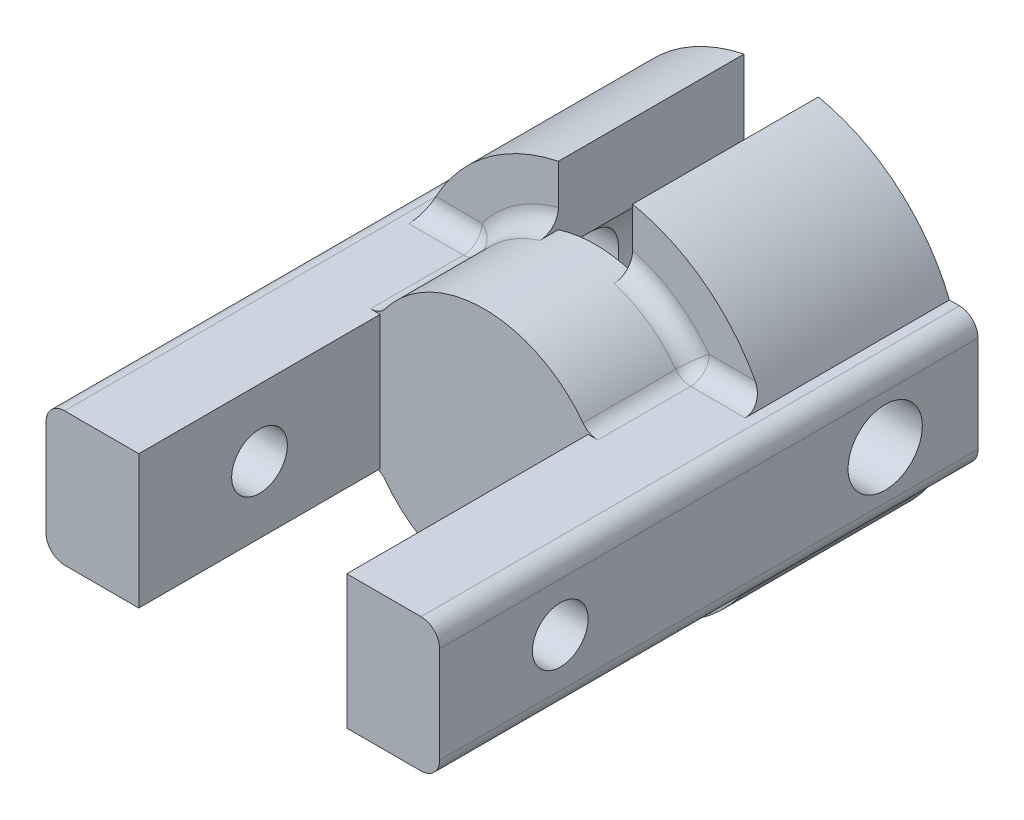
ISO-10303-21;
HEADER;
FILE_DESCRIPTION(('STEP AP214'),'2;1');
FILE_NAME('part.step','',(''),(''),'','','');
FILE_SCHEMA(('AUTOMOTIVE_DESIGN { 1 0 10303 214 1 1 1 1 }'));
ENDSEC;
DATA;
#1=APPLICATION_CONTEXT('core data for automotive mechanical design processes');
#2=APPLICATION_PROTOCOL_DEFINITION('international standard','automotive_design',2000,#1);
#3=PRODUCT_CONTEXT('',#1,'mechanical');
#4=PRODUCT('Part','Part','',(#3));
#5=PRODUCT_RELATED_PRODUCT_CATEGORY('part','',(#4));
#6=PRODUCT_DEFINITION_FORMATION('','',#4);
#7=PRODUCT_DEFINITION_CONTEXT('part definition',#1,'design');
#8=PRODUCT_DEFINITION('design','',#6,#7);
#9=PRODUCT_DEFINITION_SHAPE('','',#8);
#10=(LENGTH_UNIT() NAMED_UNIT(*) SI_UNIT(.MILLI.,.METRE.));
#11=(NAMED_UNIT(*) PLANE_ANGLE_UNIT() SI_UNIT($,.RADIAN.));
#12=(NAMED_UNIT(*) SI_UNIT($,.STERADIAN.) SOLID_ANGLE_UNIT());
#13=UNCERTAINTY_MEASURE_WITH_UNIT(LENGTH_MEASURE(1.E-05),#10,'distance_accuracy_value','');
#14=(GEOMETRIC_REPRESENTATION_CONTEXT(3) GLOBAL_UNCERTAINTY_ASSIGNED_CONTEXT((#13)) GLOBAL_UNIT_ASSIGNED_CONTEXT((#10,
#11,#12)) REPRESENTATION_CONTEXT('',''));
#15=CARTESIAN_POINT('',(0.,0.,0.));
#16=DIRECTION('',(0.,0.,1.));
#17=DIRECTION('',(1.,0.,0.));
#18=AXIS2_PLACEMENT_3D('',#15,#16,#17);
#19=CARTESIAN_POINT('',(0.,0.,-8.));
#20=DIRECTION('',(0.,0.,1.));
#21=DIRECTION('',(1.,0.,0.));
#22=AXIS2_PLACEMENT_3D('',#19,#20,#21);
#23=PLANE('',#22);
#24=DIRECTION('',(-1.,0.,0.));
#25=VECTOR('',#24,1.);
#26=CARTESIAN_POINT('',(0.,-1.8,-8.));
#27=LINE('',#26,#25);
#28=CARTESIAN_POINT('',(-4.53052149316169,-1.8,-8.));
#29=VERTEX_POINT('',#28);
#30=CARTESIAN_POINT('',(-4.8,-1.8,-8.));
#31=VERTEX_POINT('',#30);
#32=EDGE_CURVE('E397',#29,#31,#27,.T.);
#33=ORIENTED_EDGE('',*,*,#32,.T.);
#34=CARTESIAN_POINT('',(-4.8,-1.3,-8.));
#35=DIRECTION('',(0.,0.,1.));
#36=DIRECTION('',(1.,0.,0.));
#37=AXIS2_PLACEMENT_3D('',#34,#35,#36);
#38=CIRCLE('',#37,0.5);
#39=CARTESIAN_POINT('',(-5.3,-1.3,-8.));
#40=VERTEX_POINT('',#39);
#41=EDGE_CURVE('E652',#31,#40,#38,.F.);
#42=ORIENTED_EDGE('',*,*,#41,.T.);
#43=DIRECTION('',(0.,-1.,0.));
#44=VECTOR('',#43,1.);
#45=CARTESIAN_POINT('',(-5.3,0.,-8.));
#46=LINE('',#45,#44);
#47=CARTESIAN_POINT('',(-5.3,1.3,-8.));
#48=VERTEX_POINT('',#47);
#49=EDGE_CURVE('E394',#48,#40,#46,.T.);
#50=ORIENTED_EDGE('',*,*,#49,.F.);
#51=CARTESIAN_POINT('',(-4.8,1.3,-8.));
#52=DIRECTION('',(0.,0.,1.));
#53=DIRECTION('',(1.,0.,0.));
#54=AXIS2_PLACEMENT_3D('',#51,#52,#53);
#55=CIRCLE('',#54,0.5);
#56=CARTESIAN_POINT('',(-4.8,1.8,-8.));
#57=VERTEX_POINT('',#56);
#58=EDGE_CURVE('E654',#48,#57,#55,.F.);
#59=ORIENTED_EDGE('',*,*,#58,.T.);
#60=DIRECTION('',(-1.,0.,0.));
#61=VECTOR('',#60,1.);
#62=CARTESIAN_POINT('',(0.,1.8,-8.));
#63=LINE('',#62,#61);
#64=CARTESIAN_POINT('',(-4.53052149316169,1.8,-8.));
#65=VERTEX_POINT('',#64);
#66=EDGE_CURVE('E391',#65,#57,#63,.T.);
#67=ORIENTED_EDGE('',*,*,#66,.F.);
#68=CARTESIAN_POINT('',(0.,0.,-8.));
#69=DIRECTION('',(0.,0.,-1.));
#70=DIRECTION('',(-1.,0.,0.));
#71=AXIS2_PLACEMENT_3D('',#68,#69,#70);
#72=CIRCLE('',#71,4.875);
#73=CARTESIAN_POINT('',(-0.999999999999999,4.77133367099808,-8.));
#74=VERTEX_POINT('',#73);
#75=EDGE_CURVE('E353',#65,#74,#72,.T.);
#76=ORIENTED_EDGE('',*,*,#75,.T.);
#77=DIRECTION('',(0.,-1.,0.));
#78=VECTOR('',#77,1.);
#79=CARTESIAN_POINT('',(-0.999999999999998,0.,-8.));
#80=LINE('',#79,#78);
#81=CARTESIAN_POINT('',(-0.999999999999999,2.69548233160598,-8.));
#82=VERTEX_POINT('',#81);
#83=EDGE_CURVE('E779',#74,#82,#80,.T.);
#84=ORIENTED_EDGE('',*,*,#83,.T.);
#85=CARTESIAN_POINT('',(0.,0.,-8.));
#86=DIRECTION('',(0.,0.,-1.));
#87=DIRECTION('',(-1.,0.,0.));
#88=AXIS2_PLACEMENT_3D('',#85,#86,#87);
#89=CIRCLE('',#88,2.875);
#90=CARTESIAN_POINT('',(-0.999999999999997,-2.69548233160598,-8.));
#91=VERTEX_POINT('',#90);
#92=EDGE_CURVE('E341',#91,#82,#89,.T.);
#93=ORIENTED_EDGE('',*,*,#92,.F.);
#94=CARTESIAN_POINT('',(-0.999999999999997,-4.77133367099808,-8.));
#95=VERTEX_POINT('',#94);
#96=EDGE_CURVE('E771',#91,#95,#80,.T.);
#97=ORIENTED_EDGE('',*,*,#96,.T.);
#98=CARTESIAN_POINT('',(0.,0.,-8.));
#99=DIRECTION('',(0.,0.,-1.));
#100=DIRECTION('',(-1.,0.,0.));
#101=AXIS2_PLACEMENT_3D('',#98,#99,#100);
#102=CIRCLE('',#101,4.875);
#103=EDGE_CURVE('E327',#95,#29,#102,.T.);
#104=ORIENTED_EDGE('',*,*,#103,.T.);
#105=EDGE_LOOP('',(#33,#42,#50,#59,#67,#76,#84,#93,#97,#104));
#106=FACE_BOUND('',#105,.T.);
#107=ADVANCED_FACE('F33',(#106),#23,.F.);
#108=CARTESIAN_POINT('',(0.,0.,-3.));
#109=DIRECTION('',(0.,0.,-1.));
#110=DIRECTION('',(-1.,0.,0.));
#111=AXIS2_PLACEMENT_3D('',#108,#109,#110);
#112=CYLINDRICAL_SURFACE('',#111,4.875);
#113=DIRECTION('',(0.,0.,-1.));
#114=VECTOR('',#113,1.);
#115=CARTESIAN_POINT('',(-4.53052149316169,1.8,-3.));
#116=LINE('',#115,#114);
#117=CARTESIAN_POINT('',(-4.53052149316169,1.8,-2.5));
#118=VERTEX_POINT('',#117);
#119=EDGE_CURVE('E351',#118,#65,#116,.T.);
#120=ORIENTED_EDGE('',*,*,#119,.F.);
#121=CARTESIAN_POINT('',(-4.53052149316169,1.8,-2.5));
#122=CARTESIAN_POINT('',(-4.53052665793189,1.7999701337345,-2.52657529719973));
#123=CARTESIAN_POINT('',(-4.52968043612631,1.80211674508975,-2.5531350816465));
#124=CARTESIAN_POINT('',(-4.52632631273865,1.81053348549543,-2.60542240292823));
#125=CARTESIAN_POINT('',(-4.52382237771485,1.81679377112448,-2.63115177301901));
#126=CARTESIAN_POINT('',(-4.51719368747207,1.83321013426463,-2.68111000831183));
#127=CARTESIAN_POINT('',(-4.51306898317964,1.84336608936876,-2.7053389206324));
#128=CARTESIAN_POINT('',(-4.50327154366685,1.86717343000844,-2.75167317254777));
#129=CARTESIAN_POINT('',(-4.49759840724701,1.88082572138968,-2.77377795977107));
#130=CARTESIAN_POINT('',(-4.48465494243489,1.91148555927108,-2.81583148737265));
#131=CARTESIAN_POINT('',(-4.4773504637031,1.92856390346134,-2.83571795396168));
#132=CARTESIAN_POINT('',(-4.46136249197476,1.96526592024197,-2.87232419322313));
#133=CARTESIAN_POINT('',(-4.45267886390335,1.98488984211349,-2.88904365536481));
#134=CARTESIAN_POINT('',(-4.43348029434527,2.0274258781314,-2.92004841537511));
#135=CARTESIAN_POINT('',(-4.42288255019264,2.05046928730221,-2.93410183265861));
#136=CARTESIAN_POINT('',(-4.40050750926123,2.09805910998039,-2.95818365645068));
#137=CARTESIAN_POINT('',(-4.38872903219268,2.12260701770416,-2.96820798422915));
#138=CARTESIAN_POINT('',(-4.36421970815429,2.17255169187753,-2.98419518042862));
#139=CARTESIAN_POINT('',(-4.35148800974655,2.19794920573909,-2.99015436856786));
#140=CARTESIAN_POINT('',(-4.32535539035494,2.24894729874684,-2.99805579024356));
#141=CARTESIAN_POINT('',(-4.31195617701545,2.27454723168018,-3.00000778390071));
#142=CARTESIAN_POINT('',(-4.29832816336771,2.3,-3.));
#143=B_SPLINE_CURVE_WITH_KNOTS('',3,(#121,#122,#123,#124,#125,#126,#127,#128,#129,#130,#131,
#132,#133,#134,#135,#136,#137,#138,#139,#140,#141,#142),.UNSPECIFIED.,.F.,.F.,(4,2,2,2,2,2,2,2,
2,2,4),(0.,0.0796020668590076,0.159014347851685,0.238424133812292,0.317854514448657,
0.399136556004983,0.480426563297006,0.567053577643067,0.653768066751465,0.740560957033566,
0.827142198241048),.UNSPECIFIED.);
#144=CARTESIAN_POINT('',(-4.29832816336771,2.3,-3.));
#145=VERTEX_POINT('',#144);
#146=EDGE_CURVE('E538',#118,#145,#143,.T.);
#147=ORIENTED_EDGE('',*,*,#146,.T.);
#148=CARTESIAN_POINT('',(0.,0.,-3.));
#149=DIRECTION('',(0.,0.,-1.));
#150=DIRECTION('',(-1.,0.,0.));
#151=AXIS2_PLACEMENT_3D('',#148,#149,#150);
#152=CIRCLE('',#151,4.875);
#153=CARTESIAN_POINT('',(-0.999999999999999,4.77133367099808,-3.));
#154=VERTEX_POINT('',#153);
#155=EDGE_CURVE('E349',#145,#154,#152,.T.);
#156=ORIENTED_EDGE('',*,*,#155,.T.);
#157=DIRECTION('',(0.,0.,-1.));
#158=VECTOR('',#157,1.);
#159=CARTESIAN_POINT('',(-0.999999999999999,4.77133367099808,-3.));
#160=LINE('',#159,#158);
#161=EDGE_CURVE('E328',#154,#74,#160,.T.);
#162=ORIENTED_EDGE('',*,*,#161,.T.);
#163=ORIENTED_EDGE('',*,*,#75,.F.);
#164=EDGE_LOOP('',(#120,#147,#156,#162,#163));
#165=FACE_BOUND('',#164,.T.);
#166=ADVANCED_FACE('F558',(#165),#112,.T.);
#167=CARTESIAN_POINT('',(0.,0.,-3.));
#168=DIRECTION('',(0.,0.,-1.));
#169=DIRECTION('',(-1.,0.,0.));
#170=AXIS2_PLACEMENT_3D('',#167,#168,#169);
#171=PLANE('',#170);
#172=DIRECTION('',(1.,0.,0.));
#173=VECTOR('',#172,1.);
#174=CARTESIAN_POINT('',(-2.8,2.3,-3.));
#175=LINE('',#174,#173);
#176=CARTESIAN_POINT('',(-3.06082724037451,2.3,-3.));
#177=VERTEX_POINT('',#176);
#178=EDGE_CURVE('E733',#145,#177,#175,.T.);
#179=ORIENTED_EDGE('',*,*,#178,.T.);
#180=CARTESIAN_POINT('',(0.,0.,-3.));
#181=DIRECTION('',(0.,0.,-1.));
#182=DIRECTION('',(-1.,0.,0.));
#183=AXIS2_PLACEMENT_3D('',#180,#181,#182);
#184=CIRCLE('',#183,3.82866339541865);
#185=CARTESIAN_POINT('',(-0.999999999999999,3.6957628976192,-3.));
#186=VERTEX_POINT('',#185);
#187=EDGE_CURVE('E730',#177,#186,#184,.T.);
#188=ORIENTED_EDGE('',*,*,#187,.T.);
#189=DIRECTION('',(0.,-1.,0.));
#190=VECTOR('',#189,1.);
#191=CARTESIAN_POINT('',(-0.999999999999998,0.,-3.));
#192=LINE('',#191,#190);
#193=EDGE_CURVE('E319',#154,#186,#192,.T.);
#194=ORIENTED_EDGE('',*,*,#193,.F.);
#195=ORIENTED_EDGE('',*,*,#155,.F.);
#196=EDGE_LOOP('',(#179,#188,#194,#195));
#197=FACE_BOUND('',#196,.T.);
#198=ADVANCED_FACE('F957',(#197),#171,.F.);
#199=CARTESIAN_POINT('',(0.,0.,-3.));
#200=DIRECTION('',(0.,0.,-1.));
#201=DIRECTION('',(-1.,0.,0.));
#202=AXIS2_PLACEMENT_3D('',#199,#200,#201);
#203=CYLINDRICAL_SURFACE('',#202,4.875);
#204=ORIENTED_EDGE('',*,*,#103,.F.);
#205=DIRECTION('',(0.,0.,-1.));
#206=VECTOR('',#205,1.);
#207=CARTESIAN_POINT('',(-0.999999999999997,-4.77133367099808,-3.));
#208=LINE('',#207,#206);
#209=CARTESIAN_POINT('',(-0.999999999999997,-4.77133367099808,-3.));
#210=VERTEX_POINT('',#209);
#211=EDGE_CURVE('E308',#210,#95,#208,.T.);
#212=ORIENTED_EDGE('',*,*,#211,.F.);
#213=CARTESIAN_POINT('',(0.,0.,-3.));
#214=DIRECTION('',(0.,0.,-1.));
#215=DIRECTION('',(-1.,0.,0.));
#216=AXIS2_PLACEMENT_3D('',#213,#214,#215);
#217=CIRCLE('',#216,4.875);
#218=CARTESIAN_POINT('',(-4.29832816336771,-2.3,-3.));
#219=VERTEX_POINT('',#218);
#220=EDGE_CURVE('E324',#210,#219,#217,.T.);
#221=ORIENTED_EDGE('',*,*,#220,.T.);
#222=CARTESIAN_POINT('',(-4.29832816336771,-2.3,-3.));
#223=CARTESIAN_POINT('',(-4.31427927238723,-2.27022002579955,-3.00001664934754));
#224=CARTESIAN_POINT('',(-4.32991580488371,-2.24022427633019,-2.99733796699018));
#225=CARTESIAN_POINT('',(-4.36024142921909,-2.18059770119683,-2.98647869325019));
#226=CARTESIAN_POINT('',(-4.37492624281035,-2.15096895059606,-2.97827492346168));
#227=CARTESIAN_POINT('',(-4.40293074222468,-2.09305353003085,-2.95621960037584));
#228=CARTESIAN_POINT('',(-4.4162462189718,-2.06477113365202,-2.94235124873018));
#229=CARTESIAN_POINT('',(-4.4410712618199,-2.01081803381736,-2.90911412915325));
#230=CARTESIAN_POINT('',(-4.45258438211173,-1.98514222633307,-2.88975640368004));
#231=CARTESIAN_POINT('',(-4.47259420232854,-1.93961149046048,-2.84784117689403));
#232=CARTESIAN_POINT('',(-4.4812657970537,-1.9194450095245,-2.82570605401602));
#233=CARTESIAN_POINT('',(-4.4966427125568,-1.88314079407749,-2.77772629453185));
#234=CARTESIAN_POINT('',(-4.5033479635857,-1.86700320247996,-2.75188152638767));
#235=CARTESIAN_POINT('',(-4.51410547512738,-1.84083108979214,-2.69983511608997));
#236=CARTESIAN_POINT('',(-4.51834490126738,-1.83037201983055,-2.67388449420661));
#237=CARTESIAN_POINT('',(-4.52497828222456,-1.81391197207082,-2.62040604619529));
#238=CARTESIAN_POINT('',(-4.52737558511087,-1.80790290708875,-2.59288117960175));
#239=CARTESIAN_POINT('',(-4.52939519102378,-1.80283268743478,-2.5542562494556));
#240=CARTESIAN_POINT('',(-4.52981776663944,-1.80177040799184,-2.54342762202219));
#241=CARTESIAN_POINT('',(-4.53038053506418,-1.80035490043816,-2.5217344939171));
#242=CARTESIAN_POINT('',(-4.53052118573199,-1.80000052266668,-2.51087008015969));
#243=CARTESIAN_POINT('',(-4.53052149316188,-1.79999999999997,-2.50000000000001));
#244=B_SPLINE_CURVE_WITH_KNOTS('',3,(#222,#223,#224,#225,#226,#227,#228,#229,#230,#231,#232,
#233,#234,#235,#236,#237,#238,#239,#240,#241,#242,#243),.UNSPECIFIED.,.F.,.F.,(4,2,2,2,2,2,2,2,
2,2,4),(0.,0.101305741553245,0.203039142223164,0.305076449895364,0.406909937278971,
0.499923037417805,0.592939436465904,0.677408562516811,0.761723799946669,0.794369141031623,
0.826961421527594),.UNSPECIFIED.);
#245=CARTESIAN_POINT('',(-4.53052149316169,-1.8,-2.5));
#246=VERTEX_POINT('',#245);
#247=EDGE_CURVE('E11',#219,#246,#244,.T.);
#248=ORIENTED_EDGE('',*,*,#247,.T.);
#249=DIRECTION('',(0.,0.,-1.));
#250=VECTOR('',#249,1.);
#251=CARTESIAN_POINT('',(-4.53052149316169,-1.8,-3.));
#252=LINE('',#251,#250);
#253=EDGE_CURVE('E344',#246,#29,#252,.T.);
#254=ORIENTED_EDGE('',*,*,#253,.T.);
#255=EDGE_LOOP('',(#204,#212,#221,#248,#254));
#256=FACE_BOUND('',#255,.T.);
#257=ADVANCED_FACE('F323',(#256),#203,.T.);
#258=CARTESIAN_POINT('',(0.,0.,-3.));
#259=DIRECTION('',(0.,0.,-1.));
#260=DIRECTION('',(-1.,0.,0.));
#261=AXIS2_PLACEMENT_3D('',#258,#259,#260);
#262=PLANE('',#261);
#263=CARTESIAN_POINT('',(-0.999999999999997,-3.6957628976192,-3.));
#264=VERTEX_POINT('',#263);
#265=EDGE_CURVE('E304',#264,#210,#192,.T.);
#266=ORIENTED_EDGE('',*,*,#265,.F.);
#267=CARTESIAN_POINT('',(0.,0.,-3.));
#268=DIRECTION('',(0.,0.,-1.));
#269=DIRECTION('',(-1.,0.,0.));
#270=AXIS2_PLACEMENT_3D('',#267,#268,#269);
#271=CIRCLE('',#270,3.82866339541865);
#272=CARTESIAN_POINT('',(-3.06082724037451,-2.3,-3.));
#273=VERTEX_POINT('',#272);
#274=EDGE_CURVE('E735',#264,#273,#271,.T.);
#275=ORIENTED_EDGE('',*,*,#274,.T.);
#276=DIRECTION('',(-1.,0.,0.));
#277=VECTOR('',#276,1.);
#278=CARTESIAN_POINT('',(0.,-2.3,-3.));
#279=LINE('',#278,#277);
#280=EDGE_CURVE('E333',#273,#219,#279,.T.);
#281=ORIENTED_EDGE('',*,*,#280,.T.);
#282=ORIENTED_EDGE('',*,*,#220,.F.);
#283=EDGE_LOOP('',(#266,#275,#281,#282));
#284=FACE_BOUND('',#283,.T.);
#285=ADVANCED_FACE('F331',(#284),#262,.F.);
#286=CARTESIAN_POINT('',(0.,0.,-8.));
#287=DIRECTION('',(0.,0.,1.));
#288=DIRECTION('',(1.,0.,0.));
#289=AXIS2_PLACEMENT_3D('',#286,#287,#288);
#290=CYLINDRICAL_SURFACE('',#289,3.32866339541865);
#291=CARTESIAN_POINT('',(0.,0.,-3.));
#292=DIRECTION('',(0.,0.,-1.));
#293=DIRECTION('',(-1.,0.,0.));
#294=AXIS2_PLACEMENT_3D('',#291,#292,#293);
#295=CIRCLE('',#294,3.32866339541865);
#296=CARTESIAN_POINT('',(-0.999999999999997,-3.17490157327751,-3.));
#297=VERTEX_POINT('',#296);
#298=CARTESIAN_POINT('',(0.999999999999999,-3.17490157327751,-3.));
#299=VERTEX_POINT('',#298);
#300=EDGE_CURVE('E793',#297,#299,#295,.F.);
#301=ORIENTED_EDGE('',*,*,#300,.T.);
#302=DIRECTION('',(0.,0.,1.));
#303=VECTOR('',#302,1.);
#304=CARTESIAN_POINT('',(0.999999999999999,-3.17490157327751,-3.));
#305=LINE('',#304,#303);
#306=CARTESIAN_POINT('',(0.999999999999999,-3.17490157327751,-2.5));
#307=VERTEX_POINT('',#306);
#308=EDGE_CURVE('E738',#299,#307,#305,.T.);
#309=ORIENTED_EDGE('',*,*,#308,.T.);
#310=CARTESIAN_POINT('',(0.,0.,-2.5));
#311=DIRECTION('',(0.,0.,-1.));
#312=DIRECTION('',(-1.,0.,0.));
#313=AXIS2_PLACEMENT_3D('',#310,#311,#312);
#314=CIRCLE('',#313,3.32866339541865);
#315=CARTESIAN_POINT('',(2.66110194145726,-1.99963408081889,-2.5));
#316=VERTEX_POINT('',#315);
#317=EDGE_CURVE('E740',#307,#316,#314,.F.);
#318=ORIENTED_EDGE('',*,*,#317,.T.);
#319=DIRECTION('',(0.,0.,1.));
#320=VECTOR('',#319,1.);
#321=CARTESIAN_POINT('',(2.66110194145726,-1.99963408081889,-8.));
#322=LINE('',#321,#320);
#323=CARTESIAN_POINT('',(2.66110194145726,-1.99963408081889,0.));
#324=VERTEX_POINT('',#323);
#325=EDGE_CURVE('E742',#316,#324,#322,.T.);
#326=ORIENTED_EDGE('',*,*,#325,.T.);
#327=CARTESIAN_POINT('',(0.,0.,0.));
#328=DIRECTION('',(0.,0.,1.));
#329=DIRECTION('',(1.,0.,0.));
#330=AXIS2_PLACEMENT_3D('',#327,#328,#329);
#331=CIRCLE('',#330,3.32866339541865);
#332=CARTESIAN_POINT('',(-2.66110194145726,-1.99963408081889,0.));
#333=VERTEX_POINT('',#332);
#334=EDGE_CURVE('E380',#333,#324,#331,.T.);
#335=ORIENTED_EDGE('',*,*,#334,.F.);
#336=DIRECTION('',(0.,0.,1.));
#337=VECTOR('',#336,1.);
#338=CARTESIAN_POINT('',(-2.66110194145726,-1.99963408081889,-8.));
#339=LINE('',#338,#337);
#340=CARTESIAN_POINT('',(-2.66110194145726,-1.99963408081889,-2.5));
#341=VERTEX_POINT('',#340);
#342=EDGE_CURVE('E749',#333,#341,#339,.F.);
#343=ORIENTED_EDGE('',*,*,#342,.T.);
#344=CARTESIAN_POINT('',(0.,0.,-2.5));
#345=DIRECTION('',(0.,0.,-1.));
#346=DIRECTION('',(-1.,0.,0.));
#347=AXIS2_PLACEMENT_3D('',#344,#345,#346);
#348=CIRCLE('',#347,3.32866339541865);
#349=CARTESIAN_POINT('',(-0.999999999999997,-3.17490157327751,-2.5));
#350=VERTEX_POINT('',#349);
#351=EDGE_CURVE('E746',#341,#350,#348,.F.);
#352=ORIENTED_EDGE('',*,*,#351,.T.);
#353=DIRECTION('',(0.,0.,1.));
#354=VECTOR('',#353,1.);
#355=CARTESIAN_POINT('',(-0.999999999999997,-3.17490157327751,-2.5));
#356=LINE('',#355,#354);
#357=EDGE_CURVE('E744',#350,#297,#356,.F.);
#358=ORIENTED_EDGE('',*,*,#357,.T.);
#359=EDGE_LOOP('',(#301,#309,#318,#326,#335,#343,#352,#358));
#360=FACE_BOUND('',#359,.T.);
#361=ADVANCED_FACE('F579',(#360),#290,.T.);
#362=CARTESIAN_POINT('',(0.,0.,-3.));
#363=DIRECTION('',(0.,0.,-1.));
#364=DIRECTION('',(-1.,0.,0.));
#365=AXIS2_PLACEMENT_3D('',#362,#363,#364);
#366=CIRCLE('',#365,3.32866339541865);
#367=CARTESIAN_POINT('',(0.999999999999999,3.17490157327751,-3.));
#368=VERTEX_POINT('',#367);
#369=CARTESIAN_POINT('',(-0.999999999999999,3.17490157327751,-3.));
#370=VERTEX_POINT('',#369);
#371=EDGE_CURVE('E787',#368,#370,#366,.F.);
#372=ORIENTED_EDGE('',*,*,#371,.T.);
#373=DIRECTION('',(0.,0.,1.));
#374=VECTOR('',#373,1.);
#375=CARTESIAN_POINT('',(-0.999999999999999,3.17490157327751,-3.));
#376=LINE('',#375,#374);
#377=CARTESIAN_POINT('',(-0.999999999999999,3.17490157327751,-2.5));
#378=VERTEX_POINT('',#377);
#379=EDGE_CURVE('E716',#370,#378,#376,.T.);
#380=ORIENTED_EDGE('',*,*,#379,.T.);
#381=CARTESIAN_POINT('',(0.,0.,-2.5));
#382=DIRECTION('',(0.,0.,-1.));
#383=DIRECTION('',(-1.,0.,0.));
#384=AXIS2_PLACEMENT_3D('',#381,#382,#383);
#385=CIRCLE('',#384,3.32866339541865);
#386=CARTESIAN_POINT('',(-2.66110194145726,1.99963408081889,-2.5));
#387=VERTEX_POINT('',#386);
#388=EDGE_CURVE('E719',#378,#387,#385,.F.);
#389=ORIENTED_EDGE('',*,*,#388,.T.);
#390=DIRECTION('',(0.,0.,1.));
#391=VECTOR('',#390,1.);
#392=CARTESIAN_POINT('',(-2.66110194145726,1.99963408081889,-8.));
#393=LINE('',#392,#391);
#394=CARTESIAN_POINT('',(-2.66110194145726,1.99963408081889,0.));
#395=VERTEX_POINT('',#394);
#396=EDGE_CURVE('E721',#387,#395,#393,.T.);
#397=ORIENTED_EDGE('',*,*,#396,.T.);
#398=CARTESIAN_POINT('',(2.66110194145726,1.99963408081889,0.));
#399=VERTEX_POINT('',#398);
#400=EDGE_CURVE('E385',#399,#395,#331,.T.);
#401=ORIENTED_EDGE('',*,*,#400,.F.);
#402=DIRECTION('',(0.,0.,1.));
#403=VECTOR('',#402,1.);
#404=CARTESIAN_POINT('',(2.66110194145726,1.99963408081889,-8.));
#405=LINE('',#404,#403);
#406=CARTESIAN_POINT('',(2.66110194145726,1.99963408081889,-2.5));
#407=VERTEX_POINT('',#406);
#408=EDGE_CURVE('E728',#399,#407,#405,.F.);
#409=ORIENTED_EDGE('',*,*,#408,.T.);
#410=CARTESIAN_POINT('',(0.,0.,-2.5));
#411=DIRECTION('',(0.,0.,-1.));
#412=DIRECTION('',(-1.,0.,0.));
#413=AXIS2_PLACEMENT_3D('',#410,#411,#412);
#414=CIRCLE('',#413,3.32866339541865);
#415=CARTESIAN_POINT('',(0.999999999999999,3.17490157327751,-2.5));
#416=VERTEX_POINT('',#415);
#417=EDGE_CURVE('E725',#407,#416,#414,.F.);
#418=ORIENTED_EDGE('',*,*,#417,.T.);
#419=DIRECTION('',(0.,0.,1.));
#420=VECTOR('',#419,1.);
#421=CARTESIAN_POINT('',(0.999999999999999,3.17490157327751,-2.5));
#422=LINE('',#421,#420);
#423=EDGE_CURVE('E723',#416,#368,#422,.F.);
#424=ORIENTED_EDGE('',*,*,#423,.T.);
#425=EDGE_LOOP('',(#372,#380,#389,#397,#401,#409,#418,#424));
#426=FACE_BOUND('',#425,.T.);
#427=ADVANCED_FACE('F575',(#426),#290,.T.);
#428=CARTESIAN_POINT('',(0.,-1.8,6.5));
#429=DIRECTION('',(0.,-1.,0.));
#430=DIRECTION('',(1.,0.,0.));
#431=AXIS2_PLACEMENT_3D('',#428,#429,#430);
#432=PLANE('',#431);
#433=DIRECTION('',(0.,0.,-1.));
#434=VECTOR('',#433,1.);
#435=CARTESIAN_POINT('',(-3.06082724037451,-1.8,0.));
#436=LINE('',#435,#434);
#437=CARTESIAN_POINT('',(-3.06082724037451,-1.8,-2.5));
#438=VERTEX_POINT('',#437);
#439=CARTESIAN_POINT('',(-3.06082724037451,-1.8,0.));
#440=VERTEX_POINT('',#439);
#441=EDGE_CURVE('E688',#438,#440,#436,.F.);
#442=ORIENTED_EDGE('',*,*,#441,.T.);
#443=DIRECTION('',(1.,0.,0.));
#444=VECTOR('',#443,1.);
#445=CARTESIAN_POINT('',(0.,-1.8,0.));
#446=LINE('',#445,#444);
#447=CARTESIAN_POINT('',(-2.8,-1.8,0.));
#448=VERTEX_POINT('',#447);
#449=EDGE_CURVE('E686',#440,#448,#446,.T.);
#450=ORIENTED_EDGE('',*,*,#449,.T.);
#451=DIRECTION('',(0.,0.,-1.));
#452=VECTOR('',#451,1.);
#453=CARTESIAN_POINT('',(-2.8,-1.8,6.5));
#454=LINE('',#453,#452);
#455=CARTESIAN_POINT('',(-2.8,-1.8,6.5));
#456=VERTEX_POINT('',#455);
#457=EDGE_CURVE('E418',#456,#448,#454,.T.);
#458=ORIENTED_EDGE('',*,*,#457,.F.);
#459=DIRECTION('',(-1.,0.,0.));
#460=VECTOR('',#459,1.);
#461=CARTESIAN_POINT('',(0.,-1.8,6.5));
#462=LINE('',#461,#460);
#463=CARTESIAN_POINT('',(-4.8,-1.8,6.5));
#464=VERTEX_POINT('',#463);
#465=EDGE_CURVE('E403',#456,#464,#462,.T.);
#466=ORIENTED_EDGE('',*,*,#465,.T.);
#467=DIRECTION('',(0.,0.,-1.));
#468=VECTOR('',#467,1.);
#469=CARTESIAN_POINT('',(-4.8,-1.8,-8.));
#470=LINE('',#469,#468);
#471=EDGE_CURVE('E693',#464,#31,#470,.T.);
#472=ORIENTED_EDGE('',*,*,#471,.T.);
#473=ORIENTED_EDGE('',*,*,#32,.F.);
#474=ORIENTED_EDGE('',*,*,#253,.F.);
#475=DIRECTION('',(-1.,0.,0.));
#476=VECTOR('',#475,1.);
#477=CARTESIAN_POINT('',(0.,-1.8,-2.5));
#478=LINE('',#477,#476);
#479=EDGE_CURVE('E691',#246,#438,#478,.F.);
#480=ORIENTED_EDGE('',*,*,#479,.T.);
#481=EDGE_LOOP('',(#442,#450,#458,#466,#472,#473,#474,#480));
#482=FACE_BOUND('',#481,.T.);
#483=ADVANCED_FACE('F578',(#482),#432,.T.);
#484=CARTESIAN_POINT('',(-2.8,0.,6.5));
#485=DIRECTION('',(-1.,0.,0.));
#486=DIRECTION('',(0.,-1.,0.));
#487=AXIS2_PLACEMENT_3D('',#484,#485,#486);
#488=PLANE('',#487);
#489=CARTESIAN_POINT('',(-2.8,0.,3.25));
#490=DIRECTION('',(-1.,0.,0.));
#491=DIRECTION('',(0.,-1.,0.));
#492=AXIS2_PLACEMENT_3D('',#489,#490,#491);
#493=CIRCLE('',#492,0.750000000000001);
#494=CARTESIAN_POINT('',(-2.8,-0.750000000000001,3.25));
#495=VERTEX_POINT('',#494);
#496=EDGE_CURVE('E760',#495,#495,#493,.T.);
#497=ORIENTED_EDGE('',*,*,#496,.T.);
#498=EDGE_LOOP('',(#497));
#499=FACE_BOUND('',#498,.T.);
#500=DIRECTION('',(0.,1.,0.));
#501=VECTOR('',#500,1.);
#502=CARTESIAN_POINT('',(-2.8,0.,0.));
#503=LINE('',#502,#501);
#504=CARTESIAN_POINT('',(-2.8,1.8,0.));
#505=VERTEX_POINT('',#504);
#506=EDGE_CURVE('E400',#448,#505,#503,.T.);
#507=ORIENTED_EDGE('',*,*,#506,.T.);
#508=DIRECTION('',(0.,0.,-1.));
#509=VECTOR('',#508,1.);
#510=CARTESIAN_POINT('',(-2.8,1.8,6.5));
#511=LINE('',#510,#509);
#512=CARTESIAN_POINT('',(-2.8,1.8,6.5));
#513=VERTEX_POINT('',#512);
#514=EDGE_CURVE('E414',#513,#505,#511,.T.);
#515=ORIENTED_EDGE('',*,*,#514,.F.);
#516=DIRECTION('',(0.,1.,0.));
#517=VECTOR('',#516,1.);
#518=CARTESIAN_POINT('',(-2.8,0.,6.5));
#519=LINE('',#518,#517);
#520=EDGE_CURVE('E406',#456,#513,#519,.T.);
#521=ORIENTED_EDGE('',*,*,#520,.F.);
#522=ORIENTED_EDGE('',*,*,#457,.T.);
#523=EDGE_LOOP('',(#507,#515,#521,#522));
#524=FACE_BOUND('',#523,.T.);
#525=ADVANCED_FACE('F603',(#499,#524),#488,.F.);
#526=CARTESIAN_POINT('',(0.,1.8,6.5));
#527=DIRECTION('',(0.,-1.,0.));
#528=DIRECTION('',(1.,0.,0.));
#529=AXIS2_PLACEMENT_3D('',#526,#527,#528);
#530=PLANE('',#529);
#531=ORIENTED_EDGE('',*,*,#514,.T.);
#532=DIRECTION('',(-1.,0.,0.));
#533=VECTOR('',#532,1.);
#534=CARTESIAN_POINT('',(0.,1.8,0.));
#535=LINE('',#534,#533);
#536=CARTESIAN_POINT('',(-3.06082724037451,1.8,0.));
#537=VERTEX_POINT('',#536);
#538=EDGE_CURVE('E50',#505,#537,#535,.T.);
#539=ORIENTED_EDGE('',*,*,#538,.T.);
#540=DIRECTION('',(0.,0.,1.));
#541=VECTOR('',#540,1.);
#542=CARTESIAN_POINT('',(-3.06082724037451,1.8,6.5));
#543=LINE('',#542,#541);
#544=CARTESIAN_POINT('',(-3.06082724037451,1.8,-2.5));
#545=VERTEX_POINT('',#544);
#546=EDGE_CURVE('E679',#537,#545,#543,.F.);
#547=ORIENTED_EDGE('',*,*,#546,.T.);
#548=DIRECTION('',(1.,0.,0.));
#549=VECTOR('',#548,1.);
#550=CARTESIAN_POINT('',(-4.53052149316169,1.8,-2.5));
#551=LINE('',#550,#549);
#552=EDGE_CURVE('E681',#545,#118,#551,.F.);
#553=ORIENTED_EDGE('',*,*,#552,.T.);
#554=ORIENTED_EDGE('',*,*,#119,.T.);
#555=ORIENTED_EDGE('',*,*,#66,.T.);
#556=DIRECTION('',(0.,0.,-1.));
#557=VECTOR('',#556,1.);
#558=CARTESIAN_POINT('',(-4.8,1.8,6.5));
#559=LINE('',#558,#557);
#560=CARTESIAN_POINT('',(-4.8,1.8,6.5));
#561=VERTEX_POINT('',#560);
#562=EDGE_CURVE('E684',#57,#561,#559,.F.);
#563=ORIENTED_EDGE('',*,*,#562,.T.);
#564=DIRECTION('',(-1.,0.,0.));
#565=VECTOR('',#564,1.);
#566=CARTESIAN_POINT('',(0.,1.8,6.5));
#567=LINE('',#566,#565);
#568=EDGE_CURVE('E408',#513,#561,#567,.T.);
#569=ORIENTED_EDGE('',*,*,#568,.F.);
#570=EDGE_LOOP('',(#531,#539,#547,#553,#554,#555,#563,#569));
#571=FACE_BOUND('',#570,.T.);
#572=ADVANCED_FACE('F599',(#571),#530,.F.);
#573=CARTESIAN_POINT('',(-5.3,0.,6.5));
#574=DIRECTION('',(1.,0.,0.));
#575=DIRECTION('',(0.,1.,0.));
#576=AXIS2_PLACEMENT_3D('',#573,#574,#575);
#577=PLANE('',#576);
#578=CARTESIAN_POINT('',(-5.3,0.,-5.5));
#579=DIRECTION('',(1.,0.,0.));
#580=DIRECTION('',(0.,1.,0.));
#581=AXIS2_PLACEMENT_3D('',#578,#579,#580);
#582=CIRCLE('',#581,1.);
#583=CARTESIAN_POINT('',(-5.3,0.999999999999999,-5.5));
#584=VERTEX_POINT('',#583);
#585=EDGE_CURVE('E757',#584,#584,#582,.T.);
#586=ORIENTED_EDGE('',*,*,#585,.T.);
#587=EDGE_LOOP('',(#586));
#588=FACE_BOUND('',#587,.T.);
#589=CARTESIAN_POINT('',(-5.3,0.,3.25));
#590=DIRECTION('',(1.,0.,0.));
#591=DIRECTION('',(0.,1.,0.));
#592=AXIS2_PLACEMENT_3D('',#589,#590,#591);
#593=CIRCLE('',#592,0.750000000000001);
#594=CARTESIAN_POINT('',(-5.3,-0.750000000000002,3.25));
#595=VERTEX_POINT('',#594);
#596=EDGE_CURVE('E756',#595,#595,#593,.T.);
#597=ORIENTED_EDGE('',*,*,#596,.T.);
#598=EDGE_LOOP('',(#597));
#599=FACE_BOUND('',#598,.T.);
#600=ORIENTED_EDGE('',*,*,#49,.T.);
#601=DIRECTION('',(0.,0.,-1.));
#602=VECTOR('',#601,1.);
#603=CARTESIAN_POINT('',(-5.3,-1.3,6.5));
#604=LINE('',#603,#602);
#605=CARTESIAN_POINT('',(-5.3,-1.3,6.5));
#606=VERTEX_POINT('',#605);
#607=EDGE_CURVE('E645',#40,#606,#604,.F.);
#608=ORIENTED_EDGE('',*,*,#607,.T.);
#609=DIRECTION('',(0.,-1.,0.));
#610=VECTOR('',#609,1.);
#611=CARTESIAN_POINT('',(-5.3,0.,6.5));
#612=LINE('',#611,#610);
#613=CARTESIAN_POINT('',(-5.3,1.3,6.5));
#614=VERTEX_POINT('',#613);
#615=EDGE_CURVE('E411',#614,#606,#612,.T.);
#616=ORIENTED_EDGE('',*,*,#615,.F.);
#617=DIRECTION('',(0.,0.,-1.));
#618=VECTOR('',#617,1.);
#619=CARTESIAN_POINT('',(-5.3,1.3,6.5));
#620=LINE('',#619,#618);
#621=EDGE_CURVE('E649',#614,#48,#620,.T.);
#622=ORIENTED_EDGE('',*,*,#621,.T.);
#623=EDGE_LOOP('',(#600,#608,#616,#622));
#624=FACE_BOUND('',#623,.T.);
#625=ADVANCED_FACE('F595',(#588,#599,#624),#577,.F.);
#626=CARTESIAN_POINT('',(0.,0.,6.5));
#627=DIRECTION('',(0.,0.,1.));
#628=DIRECTION('',(1.,0.,0.));
#629=AXIS2_PLACEMENT_3D('',#626,#627,#628);
#630=PLANE('',#629);
#631=ORIENTED_EDGE('',*,*,#615,.T.);
#632=CARTESIAN_POINT('',(-4.8,-1.3,6.5));
#633=DIRECTION('',(0.,0.,1.));
#634=DIRECTION('',(1.,0.,0.));
#635=AXIS2_PLACEMENT_3D('',#632,#633,#634);
#636=CIRCLE('',#635,0.5);
#637=EDGE_CURVE('E639',#606,#464,#636,.T.);
#638=ORIENTED_EDGE('',*,*,#637,.T.);
#639=ORIENTED_EDGE('',*,*,#465,.F.);
#640=ORIENTED_EDGE('',*,*,#520,.T.);
#641=ORIENTED_EDGE('',*,*,#568,.T.);
#642=CARTESIAN_POINT('',(-4.8,1.3,6.5));
#643=DIRECTION('',(0.,0.,1.));
#644=DIRECTION('',(1.,0.,0.));
#645=AXIS2_PLACEMENT_3D('',#642,#643,#644);
#646=CIRCLE('',#645,0.5);
#647=EDGE_CURVE('E642',#561,#614,#646,.T.);
#648=ORIENTED_EDGE('',*,*,#647,.T.);
#649=EDGE_LOOP('',(#631,#638,#639,#640,#641,#648));
#650=FACE_BOUND('',#649,.T.);
#651=ADVANCED_FACE('F585',(#650),#630,.T.);
#652=CARTESIAN_POINT('',(0.,1.8,-8.));
#653=DIRECTION('',(0.,-1.,0.));
#654=DIRECTION('',(1.,0.,0.));
#655=AXIS2_PLACEMENT_3D('',#652,#653,#654);
#656=PLANE('',#655);
#657=DIRECTION('',(0.,0.,1.));
#658=VECTOR('',#657,1.);
#659=CARTESIAN_POINT('',(3.06082724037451,1.8,-8.));
#660=LINE('',#659,#658);
#661=CARTESIAN_POINT('',(3.06082724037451,1.8,-2.5));
#662=VERTEX_POINT('',#661);
#663=CARTESIAN_POINT('',(3.06082724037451,1.8,0.));
#664=VERTEX_POINT('',#663);
#665=EDGE_CURVE('E671',#662,#664,#660,.T.);
#666=ORIENTED_EDGE('',*,*,#665,.T.);
#667=DIRECTION('',(-1.,0.,0.));
#668=VECTOR('',#667,1.);
#669=CARTESIAN_POINT('',(0.,1.8,0.));
#670=LINE('',#669,#668);
#671=CARTESIAN_POINT('',(2.8,1.8,0.));
#672=VERTEX_POINT('',#671);
#673=EDGE_CURVE('E669',#664,#672,#670,.T.);
#674=ORIENTED_EDGE('',*,*,#673,.T.);
#675=DIRECTION('',(0.,0.,-1.));
#676=VECTOR('',#675,1.);
#677=CARTESIAN_POINT('',(2.8,1.8,6.5));
#678=LINE('',#677,#676);
#679=CARTESIAN_POINT('',(2.8,1.8,6.5));
#680=VERTEX_POINT('',#679);
#681=EDGE_CURVE('E377',#680,#672,#678,.T.);
#682=ORIENTED_EDGE('',*,*,#681,.F.);
#683=DIRECTION('',(1.,0.,0.));
#684=VECTOR('',#683,1.);
#685=CARTESIAN_POINT('',(0.,1.8,6.5));
#686=LINE('',#685,#684);
#687=CARTESIAN_POINT('',(4.8,1.8,6.5));
#688=VERTEX_POINT('',#687);
#689=EDGE_CURVE('E362',#680,#688,#686,.T.);
#690=ORIENTED_EDGE('',*,*,#689,.T.);
#691=DIRECTION('',(0.,0.,1.));
#692=VECTOR('',#691,1.);
#693=CARTESIAN_POINT('',(4.8,1.8,-8.));
#694=LINE('',#693,#692);
#695=CARTESIAN_POINT('',(4.8,1.8,-8.));
#696=VERTEX_POINT('',#695);
#697=EDGE_CURVE('E676',#688,#696,#694,.F.);
#698=ORIENTED_EDGE('',*,*,#697,.T.);
#699=DIRECTION('',(1.,0.,0.));
#700=VECTOR('',#699,1.);
#701=CARTESIAN_POINT('',(0.,1.8,-8.));
#702=LINE('',#701,#700);
#703=CARTESIAN_POINT('',(4.53052149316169,1.8,-8.));
#704=VERTEX_POINT('',#703);
#705=EDGE_CURVE('E388',#704,#696,#702,.T.);
#706=ORIENTED_EDGE('',*,*,#705,.F.);
#707=DIRECTION('',(0.,0.,-1.));
#708=VECTOR('',#707,1.);
#709=CARTESIAN_POINT('',(4.53052149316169,1.8,-3.));
#710=LINE('',#709,#708);
#711=CARTESIAN_POINT('',(4.53052149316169,1.8,-2.5));
#712=VERTEX_POINT('',#711);
#713=EDGE_CURVE('E356',#712,#704,#710,.T.);
#714=ORIENTED_EDGE('',*,*,#713,.F.);
#715=DIRECTION('',(1.,0.,0.));
#716=VECTOR('',#715,1.);
#717=CARTESIAN_POINT('',(2.8,1.8,-2.5));
#718=LINE('',#717,#716);
#719=EDGE_CURVE('E674',#712,#662,#718,.F.);
#720=ORIENTED_EDGE('',*,*,#719,.T.);
#721=EDGE_LOOP('',(#666,#674,#682,#690,#698,#706,#714,#720));
#722=FACE_BOUND('',#721,.T.);
#723=ADVANCED_FACE('F581',(#722),#656,.F.);
#724=CARTESIAN_POINT('',(5.3,0.,-8.));
#725=DIRECTION('',(-1.,0.,0.));
#726=DIRECTION('',(0.,-1.,0.));
#727=AXIS2_PLACEMENT_3D('',#724,#725,#726);
#728=PLANE('',#727);
#729=CARTESIAN_POINT('',(5.3,0.,-5.5));
#730=DIRECTION('',(-1.,0.,0.));
#731=DIRECTION('',(0.,-1.,0.));
#732=AXIS2_PLACEMENT_3D('',#729,#730,#731);
#733=CIRCLE('',#732,1.);
#734=CARTESIAN_POINT('',(5.3,-0.999999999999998,-5.5));
#735=VERTEX_POINT('',#734);
#736=EDGE_CURVE('E444',#735,#735,#733,.T.);
#737=ORIENTED_EDGE('',*,*,#736,.T.);
#738=EDGE_LOOP('',(#737));
#739=FACE_BOUND('',#738,.T.);
#740=CARTESIAN_POINT('',(5.3,0.,3.25));
#741=DIRECTION('',(-1.,0.,0.));
#742=DIRECTION('',(0.,-1.,0.));
#743=AXIS2_PLACEMENT_3D('',#740,#741,#742);
#744=CIRCLE('',#743,0.750000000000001);
#745=CARTESIAN_POINT('',(5.3,-0.749999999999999,3.25));
#746=VERTEX_POINT('',#745);
#747=EDGE_CURVE('E767',#746,#746,#744,.T.);
#748=ORIENTED_EDGE('',*,*,#747,.T.);
#749=EDGE_LOOP('',(#748));
#750=FACE_BOUND('',#749,.T.);
#751=DIRECTION('',(0.,-1.,0.));
#752=VECTOR('',#751,1.);
#753=CARTESIAN_POINT('',(5.3,0.,6.5));
#754=LINE('',#753,#752);
#755=CARTESIAN_POINT('',(5.3,1.3,6.5));
#756=VERTEX_POINT('',#755);
#757=CARTESIAN_POINT('',(5.3,-1.3,6.5));
#758=VERTEX_POINT('',#757);
#759=EDGE_CURVE('E371',#756,#758,#754,.T.);
#760=ORIENTED_EDGE('',*,*,#759,.T.);
#761=DIRECTION('',(0.,0.,1.));
#762=VECTOR('',#761,1.);
#763=CARTESIAN_POINT('',(5.3,-1.3,-8.));
#764=LINE('',#763,#762);
#765=CARTESIAN_POINT('',(5.3,-1.3,-8.));
#766=VERTEX_POINT('',#765);
#767=EDGE_CURVE('E660',#758,#766,#764,.F.);
#768=ORIENTED_EDGE('',*,*,#767,.T.);
#769=DIRECTION('',(0.,-1.,0.));
#770=VECTOR('',#769,1.);
#771=CARTESIAN_POINT('',(5.3,0.,-8.));
#772=LINE('',#771,#770);
#773=CARTESIAN_POINT('',(5.3,1.3,-8.));
#774=VERTEX_POINT('',#773);
#775=EDGE_CURVE('E384',#774,#766,#772,.T.);
#776=ORIENTED_EDGE('',*,*,#775,.F.);
#777=DIRECTION('',(0.,0.,1.));
#778=VECTOR('',#777,1.);
#779=CARTESIAN_POINT('',(5.3,1.3,-8.));
#780=LINE('',#779,#778);
#781=EDGE_CURVE('E662',#774,#756,#780,.T.);
#782=ORIENTED_EDGE('',*,*,#781,.T.);
#783=EDGE_LOOP('',(#760,#768,#776,#782));
#784=FACE_BOUND('',#783,.T.);
#785=ADVANCED_FACE('F584',(#739,#750,#784),#728,.F.);
#786=CARTESIAN_POINT('',(0.,-1.8,-8.));
#787=DIRECTION('',(0.,-1.,0.));
#788=DIRECTION('',(1.,0.,0.));
#789=AXIS2_PLACEMENT_3D('',#786,#787,#788);
#790=PLANE('',#789);
#791=DIRECTION('',(0.,0.,-1.));
#792=VECTOR('',#791,1.);
#793=CARTESIAN_POINT('',(2.8,-1.8,6.5));
#794=LINE('',#793,#792);
#795=CARTESIAN_POINT('',(2.8,-1.8,6.5));
#796=VERTEX_POINT('',#795);
#797=CARTESIAN_POINT('',(2.8,-1.8,0.));
#798=VERTEX_POINT('',#797);
#799=EDGE_CURVE('E374',#796,#798,#794,.T.);
#800=ORIENTED_EDGE('',*,*,#799,.T.);
#801=DIRECTION('',(1.,0.,0.));
#802=VECTOR('',#801,1.);
#803=CARTESIAN_POINT('',(0.,-1.8,0.));
#804=LINE('',#803,#802);
#805=CARTESIAN_POINT('',(3.06082724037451,-1.8,0.));
#806=VERTEX_POINT('',#805);
#807=EDGE_CURVE('E57',#798,#806,#804,.T.);
#808=ORIENTED_EDGE('',*,*,#807,.T.);
#809=DIRECTION('',(0.,0.,-1.));
#810=VECTOR('',#809,1.);
#811=CARTESIAN_POINT('',(3.06082724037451,-1.8,-3.));
#812=LINE('',#811,#810);
#813=CARTESIAN_POINT('',(3.06082724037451,-1.8,-2.5));
#814=VERTEX_POINT('',#813);
#815=EDGE_CURVE('E697',#806,#814,#812,.T.);
#816=ORIENTED_EDGE('',*,*,#815,.T.);
#817=DIRECTION('',(-1.,0.,0.));
#818=VECTOR('',#817,1.);
#819=CARTESIAN_POINT('',(0.,-1.8,-2.5));
#820=LINE('',#819,#818);
#821=CARTESIAN_POINT('',(4.53052149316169,-1.8,-2.5));
#822=VERTEX_POINT('',#821);
#823=EDGE_CURVE('E699',#814,#822,#820,.F.);
#824=ORIENTED_EDGE('',*,*,#823,.T.);
#825=DIRECTION('',(0.,0.,-1.));
#826=VECTOR('',#825,1.);
#827=CARTESIAN_POINT('',(4.53052149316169,-1.8,-3.));
#828=LINE('',#827,#826);
#829=CARTESIAN_POINT('',(4.53052149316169,-1.8,-8.));
#830=VERTEX_POINT('',#829);
#831=EDGE_CURVE('E337',#822,#830,#828,.T.);
#832=ORIENTED_EDGE('',*,*,#831,.T.);
#833=DIRECTION('',(1.,0.,0.));
#834=VECTOR('',#833,1.);
#835=CARTESIAN_POINT('',(0.,-1.8,-8.));
#836=LINE('',#835,#834);
#837=CARTESIAN_POINT('',(4.8,-1.8,-8.));
#838=VERTEX_POINT('',#837);
#839=EDGE_CURVE('E381',#830,#838,#836,.T.);
#840=ORIENTED_EDGE('',*,*,#839,.T.);
#841=DIRECTION('',(0.,0.,1.));
#842=VECTOR('',#841,1.);
#843=CARTESIAN_POINT('',(4.8,-1.8,6.5));
#844=LINE('',#843,#842);
#845=CARTESIAN_POINT('',(4.8,-1.8,6.5));
#846=VERTEX_POINT('',#845);
#847=EDGE_CURVE('E702',#838,#846,#844,.T.);
#848=ORIENTED_EDGE('',*,*,#847,.T.);
#849=DIRECTION('',(1.,0.,0.));
#850=VECTOR('',#849,1.);
#851=CARTESIAN_POINT('',(0.,-1.8,6.5));
#852=LINE('',#851,#850);
#853=EDGE_CURVE('E368',#796,#846,#852,.T.);
#854=ORIENTED_EDGE('',*,*,#853,.F.);
#855=EDGE_LOOP('',(#800,#808,#816,#824,#832,#840,#848,#854));
#856=FACE_BOUND('',#855,.T.);
#857=ADVANCED_FACE('F571',(#856),#790,.T.);
#858=ORIENTED_EDGE('',*,*,#775,.T.);
#859=CARTESIAN_POINT('',(4.8,-1.3,-8.));
#860=DIRECTION('',(0.,0.,1.));
#861=DIRECTION('',(1.,0.,0.));
#862=AXIS2_PLACEMENT_3D('',#859,#860,#861);
#863=CIRCLE('',#862,0.5);
#864=EDGE_CURVE('E656',#766,#838,#863,.F.);
#865=ORIENTED_EDGE('',*,*,#864,.T.);
#866=ORIENTED_EDGE('',*,*,#839,.F.);
#867=CARTESIAN_POINT('',(0.999999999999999,-4.77133367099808,-8.));
#868=VERTEX_POINT('',#867);
#869=EDGE_CURVE('E335',#830,#868,#102,.T.);
#870=ORIENTED_EDGE('',*,*,#869,.T.);
#871=DIRECTION('',(0.,-1.,0.));
#872=VECTOR('',#871,1.);
#873=CARTESIAN_POINT('',(0.999999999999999,0.,-8.));
#874=LINE('',#873,#872);
#875=CARTESIAN_POINT('',(0.999999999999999,-2.69548233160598,-8.));
#876=VERTEX_POINT('',#875);
#877=EDGE_CURVE('E782',#876,#868,#874,.T.);
#878=ORIENTED_EDGE('',*,*,#877,.F.);
#879=CARTESIAN_POINT('',(0.999999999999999,2.69548233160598,-8.));
#880=VERTEX_POINT('',#879);
#881=EDGE_CURVE('E799',#880,#876,#89,.T.);
#882=ORIENTED_EDGE('',*,*,#881,.F.);
#883=CARTESIAN_POINT('',(0.999999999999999,4.77133367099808,-8.));
#884=VERTEX_POINT('',#883);
#885=EDGE_CURVE('E317',#884,#880,#874,.T.);
#886=ORIENTED_EDGE('',*,*,#885,.F.);
#887=EDGE_CURVE('E346',#884,#704,#72,.T.);
#888=ORIENTED_EDGE('',*,*,#887,.T.);
#889=ORIENTED_EDGE('',*,*,#705,.T.);
#890=CARTESIAN_POINT('',(4.8,1.3,-8.));
#891=DIRECTION('',(0.,0.,1.));
#892=DIRECTION('',(1.,0.,0.));
#893=AXIS2_PLACEMENT_3D('',#890,#891,#892);
#894=CIRCLE('',#893,0.5);
#895=EDGE_CURVE('E658',#696,#774,#894,.F.);
#896=ORIENTED_EDGE('',*,*,#895,.T.);
#897=EDGE_LOOP('',(#858,#865,#866,#870,#878,#882,#886,#888,#889,#896));
#898=FACE_BOUND('',#897,.T.);
#899=ADVANCED_FACE('F568',(#898),#23,.F.);
#900=CARTESIAN_POINT('',(0.,0.,0.));
#901=DIRECTION('',(0.,0.,1.));
#902=DIRECTION('',(1.,0.,0.));
#903=AXIS2_PLACEMENT_3D('',#900,#901,#902);
#904=PLANE('',#903);
#905=DIRECTION('',(0.,1.,0.));
#906=VECTOR('',#905,1.);
#907=CARTESIAN_POINT('',(2.8,0.,0.));
#908=LINE('',#907,#906);
#909=EDGE_CURVE('E359',#798,#672,#908,.T.);
#910=ORIENTED_EDGE('',*,*,#909,.T.);
#911=ORIENTED_EDGE('',*,*,#673,.F.);
#912=CARTESIAN_POINT('',(3.06082724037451,2.3,0.));
#913=DIRECTION('',(0.,0.,1.));
#914=DIRECTION('',(1.,0.,0.));
#915=AXIS2_PLACEMENT_3D('',#912,#913,#914);
#916=CIRCLE('',#915,0.5);
#917=EDGE_CURVE('E897',#664,#399,#916,.F.);
#918=ORIENTED_EDGE('',*,*,#917,.T.);
#919=ORIENTED_EDGE('',*,*,#400,.T.);
#920=CARTESIAN_POINT('',(-3.06082724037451,2.3,0.));
#921=DIRECTION('',(0.,0.,1.));
#922=DIRECTION('',(1.,0.,0.));
#923=AXIS2_PLACEMENT_3D('',#920,#921,#922);
#924=CIRCLE('',#923,0.5);
#925=EDGE_CURVE('E896',#395,#537,#924,.F.);
#926=ORIENTED_EDGE('',*,*,#925,.T.);
#927=ORIENTED_EDGE('',*,*,#538,.F.);
#928=ORIENTED_EDGE('',*,*,#506,.F.);
#929=ORIENTED_EDGE('',*,*,#449,.F.);
#930=CARTESIAN_POINT('',(-3.06082724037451,-2.3,0.));
#931=DIRECTION('',(0.,0.,1.));
#932=DIRECTION('',(1.,0.,0.));
#933=AXIS2_PLACEMENT_3D('',#930,#931,#932);
#934=CIRCLE('',#933,0.5);
#935=EDGE_CURVE('E894',#440,#333,#934,.F.);
#936=ORIENTED_EDGE('',*,*,#935,.T.);
#937=ORIENTED_EDGE('',*,*,#334,.T.);
#938=CARTESIAN_POINT('',(3.06082724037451,-2.3,0.));
#939=DIRECTION('',(0.,0.,1.));
#940=DIRECTION('',(1.,0.,0.));
#941=AXIS2_PLACEMENT_3D('',#938,#939,#940);
#942=CIRCLE('',#941,0.5);
#943=EDGE_CURVE('E496',#324,#806,#942,.F.);
#944=ORIENTED_EDGE('',*,*,#943,.T.);
#945=ORIENTED_EDGE('',*,*,#807,.F.);
#946=EDGE_LOOP('',(#910,#911,#918,#919,#926,#927,#928,#929,#936,#937,#944,#945));
#947=FACE_BOUND('',#946,.T.);
#948=ADVANCED_FACE('F566',(#947),#904,.T.);
#949=CARTESIAN_POINT('',(2.8,0.,6.5));
#950=DIRECTION('',(-1.,0.,0.));
#951=DIRECTION('',(0.,-1.,0.));
#952=AXIS2_PLACEMENT_3D('',#949,#950,#951);
#953=PLANE('',#952);
#954=CARTESIAN_POINT('',(2.8,0.,3.25));
#955=DIRECTION('',(-1.,0.,0.));
#956=DIRECTION('',(0.,-1.,0.));
#957=AXIS2_PLACEMENT_3D('',#954,#955,#956);
#958=CIRCLE('',#957,0.750000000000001);
#959=CARTESIAN_POINT('',(2.8,-0.75,3.25));
#960=VERTEX_POINT('',#959);
#961=EDGE_CURVE('E754',#960,#960,#958,.T.);
#962=ORIENTED_EDGE('',*,*,#961,.F.);
#963=EDGE_LOOP('',(#962));
#964=FACE_BOUND('',#963,.T.);
#965=ORIENTED_EDGE('',*,*,#909,.F.);
#966=ORIENTED_EDGE('',*,*,#799,.F.);
#967=DIRECTION('',(0.,1.,0.));
#968=VECTOR('',#967,1.);
#969=CARTESIAN_POINT('',(2.8,0.,6.5));
#970=LINE('',#969,#968);
#971=EDGE_CURVE('E365',#796,#680,#970,.T.);
#972=ORIENTED_EDGE('',*,*,#971,.T.);
#973=ORIENTED_EDGE('',*,*,#681,.T.);
#974=EDGE_LOOP('',(#965,#966,#972,#973));
#975=FACE_BOUND('',#974,.T.);
#976=ADVANCED_FACE('F562',(#964,#975),#953,.T.);
#977=CARTESIAN_POINT('',(0.,0.,6.5));
#978=DIRECTION('',(0.,0.,1.));
#979=DIRECTION('',(1.,0.,0.));
#980=AXIS2_PLACEMENT_3D('',#977,#978,#979);
#981=PLANE('',#980);
#982=ORIENTED_EDGE('',*,*,#853,.T.);
#983=CARTESIAN_POINT('',(4.8,-1.3,6.5));
#984=DIRECTION('',(0.,0.,1.));
#985=DIRECTION('',(1.,0.,0.));
#986=AXIS2_PLACEMENT_3D('',#983,#984,#985);
#987=CIRCLE('',#986,0.5);
#988=EDGE_CURVE('E665',#846,#758,#987,.T.);
#989=ORIENTED_EDGE('',*,*,#988,.T.);
#990=ORIENTED_EDGE('',*,*,#759,.F.);
#991=CARTESIAN_POINT('',(4.8,1.3,6.5));
#992=DIRECTION('',(0.,0.,1.));
#993=DIRECTION('',(1.,0.,0.));
#994=AXIS2_PLACEMENT_3D('',#991,#992,#993);
#995=CIRCLE('',#994,0.5);
#996=EDGE_CURVE('E667',#756,#688,#995,.T.);
#997=ORIENTED_EDGE('',*,*,#996,.T.);
#998=ORIENTED_EDGE('',*,*,#689,.F.);
#999=ORIENTED_EDGE('',*,*,#971,.F.);
#1000=EDGE_LOOP('',(#982,#989,#990,#997,#998,#999));
#1001=FACE_BOUND('',#1000,.T.);
#1002=ADVANCED_FACE('F556',(#1001),#981,.T.);
#1003=DIRECTION('',(0.,0.,-1.));
#1004=VECTOR('',#1003,1.);
#1005=CARTESIAN_POINT('',(0.999999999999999,4.77133367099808,-3.));
#1006=LINE('',#1005,#1004);
#1007=CARTESIAN_POINT('',(0.999999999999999,4.77133367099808,-3.));
#1008=VERTEX_POINT('',#1007);
#1009=EDGE_CURVE('E788',#1008,#884,#1006,.T.);
#1010=ORIENTED_EDGE('',*,*,#1009,.F.);
#1011=CARTESIAN_POINT('',(4.29832816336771,2.3,-3.));
#1012=VERTEX_POINT('',#1011);
#1013=EDGE_CURVE('E352',#1008,#1012,#152,.T.);
#1014=ORIENTED_EDGE('',*,*,#1013,.T.);
#1015=CARTESIAN_POINT('',(4.29832816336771,2.3,-3.));
#1016=CARTESIAN_POINT('',(4.31427927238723,2.27022002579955,-3.00001664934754));
#1017=CARTESIAN_POINT('',(4.32991580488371,2.24022427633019,-2.99733796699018));
#1018=CARTESIAN_POINT('',(4.36024142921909,2.18059770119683,-2.98647869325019));
#1019=CARTESIAN_POINT('',(4.37492624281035,2.15096895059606,-2.97827492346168));
#1020=CARTESIAN_POINT('',(4.40293074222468,2.09305353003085,-2.95621960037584));
#1021=CARTESIAN_POINT('',(4.4162462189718,2.06477113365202,-2.94235124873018));
#1022=CARTESIAN_POINT('',(4.4410712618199,2.01081803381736,-2.90911412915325));
#1023=CARTESIAN_POINT('',(4.45258438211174,1.98514222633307,-2.88975640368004));
#1024=CARTESIAN_POINT('',(4.47259420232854,1.93961149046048,-2.84784117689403));
#1025=CARTESIAN_POINT('',(4.48126579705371,1.9194450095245,-2.82570605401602));
#1026=CARTESIAN_POINT('',(4.4966427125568,1.88314079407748,-2.77772629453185));
#1027=CARTESIAN_POINT('',(4.5033479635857,1.86700320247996,-2.75188152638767));
#1028=CARTESIAN_POINT('',(4.51410547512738,1.84083108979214,-2.69983511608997));
#1029=CARTESIAN_POINT('',(4.51834490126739,1.83037201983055,-2.67388449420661));
#1030=CARTESIAN_POINT('',(4.52497828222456,1.81391197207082,-2.62040604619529));
#1031=CARTESIAN_POINT('',(4.52737558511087,1.80790290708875,-2.59288117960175));
#1032=CARTESIAN_POINT('',(4.52939519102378,1.80283268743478,-2.5542562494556));
#1033=CARTESIAN_POINT('',(4.52981776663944,1.80177040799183,-2.54342762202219));
#1034=CARTESIAN_POINT('',(4.53038053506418,1.80035490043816,-2.5217344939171));
#1035=CARTESIAN_POINT('',(4.53052118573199,1.80000052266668,-2.51087008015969));
#1036=CARTESIAN_POINT('',(4.53052149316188,1.79999999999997,-2.50000000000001));
#1037=B_SPLINE_CURVE_WITH_KNOTS('',3,(#1015,#1016,#1017,#1018,#1019,#1020,#1021,#1022,#1023,
#1024,#1025,#1026,#1027,#1028,#1029,#1030,#1031,#1032,#1033,#1034,#1035,#1036),.UNSPECIFIED.,
.F.,.F.,(4,2,2,2,2,2,2,2,2,2,4),(0.,0.101305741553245,0.203039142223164,0.305076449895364,
0.406909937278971,0.499923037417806,0.592939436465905,0.677408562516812,0.76172379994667,
0.794369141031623,0.826961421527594),.UNSPECIFIED.);
#1038=EDGE_CURVE('E529',#1012,#712,#1037,.T.);
#1039=ORIENTED_EDGE('',*,*,#1038,.T.);
#1040=ORIENTED_EDGE('',*,*,#713,.T.);
#1041=ORIENTED_EDGE('',*,*,#887,.F.);
#1042=EDGE_LOOP('',(#1010,#1014,#1039,#1040,#1041));
#1043=FACE_BOUND('',#1042,.T.);
#1044=ADVANCED_FACE('F550',(#1043),#112,.T.);
#1045=DIRECTION('',(0.,-1.,0.));
#1046=VECTOR('',#1045,1.);
#1047=CARTESIAN_POINT('',(0.999999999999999,0.,-3.));
#1048=LINE('',#1047,#1046);
#1049=CARTESIAN_POINT('',(0.999999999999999,3.6957628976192,-3.));
#1050=VERTEX_POINT('',#1049);
#1051=EDGE_CURVE('E329',#1008,#1050,#1048,.T.);
#1052=ORIENTED_EDGE('',*,*,#1051,.T.);
#1053=CARTESIAN_POINT('',(0.,0.,-3.));
#1054=DIRECTION('',(0.,0.,-1.));
#1055=DIRECTION('',(-1.,0.,0.));
#1056=AXIS2_PLACEMENT_3D('',#1053,#1054,#1055);
#1057=CIRCLE('',#1056,3.82866339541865);
#1058=CARTESIAN_POINT('',(3.06082724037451,2.3,-3.));
#1059=VERTEX_POINT('',#1058);
#1060=EDGE_CURVE('E711',#1050,#1059,#1057,.T.);
#1061=ORIENTED_EDGE('',*,*,#1060,.T.);
#1062=DIRECTION('',(1.,0.,0.));
#1063=VECTOR('',#1062,1.);
#1064=CARTESIAN_POINT('',(4.53052149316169,2.3,-3.));
#1065=LINE('',#1064,#1063);
#1066=EDGE_CURVE('E714',#1059,#1012,#1065,.T.);
#1067=ORIENTED_EDGE('',*,*,#1066,.T.);
#1068=ORIENTED_EDGE('',*,*,#1013,.F.);
#1069=EDGE_LOOP('',(#1052,#1061,#1067,#1068));
#1070=FACE_BOUND('',#1069,.T.);
#1071=ADVANCED_FACE('F555',(#1070),#171,.F.);
#1072=DIRECTION('',(0.,0.,-1.));
#1073=VECTOR('',#1072,1.);
#1074=CARTESIAN_POINT('',(0.999999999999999,-4.77133367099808,-3.));
#1075=LINE('',#1074,#1073);
#1076=CARTESIAN_POINT('',(0.999999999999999,-4.77133367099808,-3.));
#1077=VERTEX_POINT('',#1076);
#1078=EDGE_CURVE('E784',#1077,#868,#1075,.T.);
#1079=ORIENTED_EDGE('',*,*,#1078,.T.);
#1080=ORIENTED_EDGE('',*,*,#869,.F.);
#1081=ORIENTED_EDGE('',*,*,#831,.F.);
#1082=CARTESIAN_POINT('',(4.53052149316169,-1.8,-2.5));
#1083=CARTESIAN_POINT('',(4.53052665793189,-1.7999701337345,-2.52657529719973));
#1084=CARTESIAN_POINT('',(4.52968043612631,-1.80211674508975,-2.5531350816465));
#1085=CARTESIAN_POINT('',(4.52632631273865,-1.81053348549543,-2.60542240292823));
#1086=CARTESIAN_POINT('',(4.52382237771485,-1.81679377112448,-2.63115177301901));
#1087=CARTESIAN_POINT('',(4.51719368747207,-1.83321013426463,-2.68111000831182));
#1088=CARTESIAN_POINT('',(4.51306898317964,-1.84336608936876,-2.7053389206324));
#1089=CARTESIAN_POINT('',(4.50327154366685,-1.86717343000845,-2.75167317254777));
#1090=CARTESIAN_POINT('',(4.49759840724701,-1.88082572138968,-2.77377795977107));
#1091=CARTESIAN_POINT('',(4.48465494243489,-1.91148555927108,-2.81583148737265));
#1092=CARTESIAN_POINT('',(4.4773504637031,-1.92856390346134,-2.83571795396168));
#1093=CARTESIAN_POINT('',(4.46136249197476,-1.96526592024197,-2.87232419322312));
#1094=CARTESIAN_POINT('',(4.45267886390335,-1.98488984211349,-2.88904365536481));
#1095=CARTESIAN_POINT('',(4.43348029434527,-2.0274258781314,-2.92004841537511));
#1096=CARTESIAN_POINT('',(4.42288255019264,-2.05046928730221,-2.93410183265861));
#1097=CARTESIAN_POINT('',(4.40050750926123,-2.09805910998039,-2.95818365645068));
#1098=CARTESIAN_POINT('',(4.38872903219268,-2.12260701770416,-2.96820798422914));
#1099=CARTESIAN_POINT('',(4.36421970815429,-2.17255169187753,-2.98419518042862));
#1100=CARTESIAN_POINT('',(4.35148800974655,-2.19794920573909,-2.99015436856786));
#1101=CARTESIAN_POINT('',(4.32535539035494,-2.24894729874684,-2.99805579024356));
#1102=CARTESIAN_POINT('',(4.31195617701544,-2.27454723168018,-3.00000778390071));
#1103=CARTESIAN_POINT('',(4.29832816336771,-2.3,-3.));
#1104=B_SPLINE_CURVE_WITH_KNOTS('',3,(#1082,#1083,#1084,#1085,#1086,#1087,#1088,#1089,#1090,
#1091,#1092,#1093,#1094,#1095,#1096,#1097,#1098,#1099,#1100,#1101,#1102,#1103),.UNSPECIFIED.,
.F.,.F.,(4,2,2,2,2,2,2,2,2,2,4),(0.,0.0796020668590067,0.159014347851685,0.238424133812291,
0.317854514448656,0.399136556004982,0.480426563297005,0.567053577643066,0.653768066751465,
0.740560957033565,0.827142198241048),.UNSPECIFIED.);
#1105=CARTESIAN_POINT('',(4.29832816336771,-2.3,-3.));
#1106=VERTEX_POINT('',#1105);
#1107=EDGE_CURVE('E42',#822,#1106,#1104,.T.);
#1108=ORIENTED_EDGE('',*,*,#1107,.T.);
#1109=EDGE_CURVE('E334',#1106,#1077,#217,.T.);
#1110=ORIENTED_EDGE('',*,*,#1109,.T.);
#1111=EDGE_LOOP('',(#1079,#1080,#1081,#1108,#1110));
#1112=FACE_BOUND('',#1111,.T.);
#1113=ADVANCED_FACE('F866',(#1112),#203,.T.);
#1114=DIRECTION('',(-1.,0.,0.));
#1115=VECTOR('',#1114,1.);
#1116=CARTESIAN_POINT('',(0.,-2.3,-3.));
#1117=LINE('',#1116,#1115);
#1118=CARTESIAN_POINT('',(3.06082724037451,-2.3,-3.));
#1119=VERTEX_POINT('',#1118);
#1120=EDGE_CURVE('E434',#1106,#1119,#1117,.T.);
#1121=ORIENTED_EDGE('',*,*,#1120,.T.);
#1122=CARTESIAN_POINT('',(0.,0.,-3.));
#1123=DIRECTION('',(0.,0.,-1.));
#1124=DIRECTION('',(-1.,0.,0.));
#1125=AXIS2_PLACEMENT_3D('',#1122,#1123,#1124);
#1126=CIRCLE('',#1125,3.82866339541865);
#1127=CARTESIAN_POINT('',(0.999999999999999,-3.6957628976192,-3.));
#1128=VERTEX_POINT('',#1127);
#1129=EDGE_CURVE('E751',#1119,#1128,#1126,.T.);
#1130=ORIENTED_EDGE('',*,*,#1129,.T.);
#1131=EDGE_CURVE('E774',#1128,#1077,#1048,.T.);
#1132=ORIENTED_EDGE('',*,*,#1131,.T.);
#1133=ORIENTED_EDGE('',*,*,#1109,.F.);
#1134=EDGE_LOOP('',(#1121,#1130,#1132,#1133));
#1135=FACE_BOUND('',#1134,.T.);
#1136=ADVANCED_FACE('F942',(#1135),#262,.F.);
#1137=CARTESIAN_POINT('',(0.,0.,-1.));
#1138=DIRECTION('',(0.,0.,-1.));
#1139=DIRECTION('',(-1.,0.,0.));
#1140=AXIS2_PLACEMENT_3D('',#1137,#1138,#1139);
#1141=CYLINDRICAL_SURFACE('',#1140,2.875);
#1142=CARTESIAN_POINT('',(0.,0.,-1.5));
#1143=DIRECTION('',(0.,0.,-1.));
#1144=DIRECTION('',(-1.,0.,0.));
#1145=AXIS2_PLACEMENT_3D('',#1142,#1143,#1144);
#1146=CIRCLE('',#1145,2.875);
#1147=CARTESIAN_POINT('',(-2.875,0.,-1.5));
#1148=VERTEX_POINT('',#1147);
#1149=EDGE_CURVE('E705',#1148,#1148,#1146,.F.);
#1150=ORIENTED_EDGE('',*,*,#1149,.T.);
#1151=EDGE_LOOP('',(#1150));
#1152=FACE_BOUND('',#1151,.T.);
#1153=CARTESIAN_POINT('',(-2.875,0.,-4.5));
#1154=CARTESIAN_POINT('',(-2.87500052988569,0.0544264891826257,-4.49999923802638));
#1155=CARTESIAN_POINT('',(-2.87344049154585,0.108847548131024,-4.504457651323));
#1156=CARTESIAN_POINT('',(-2.86737155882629,0.21607860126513,-4.52211310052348));
#1157=CARTESIAN_POINT('',(-2.86286261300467,0.268888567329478,-4.53531028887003));
#1158=CARTESIAN_POINT('',(-2.85138383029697,0.371336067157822,-4.56993051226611));
#1159=CARTESIAN_POINT('',(-2.84441832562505,0.420979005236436,-4.59133907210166));
#1160=CARTESIAN_POINT('',(-2.8287315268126,0.515968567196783,-4.64170613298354));
#1161=CARTESIAN_POINT('',(-2.82000984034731,0.561314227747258,-4.67066632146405));
#1162=CARTESIAN_POINT('',(-2.80135882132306,0.648114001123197,-4.73644742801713));
#1163=CARTESIAN_POINT('',(-2.79139873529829,0.689385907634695,-4.77349999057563));
#1164=CARTESIAN_POINT('',(-2.77155647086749,0.765271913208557,-4.85392191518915));
#1165=CARTESIAN_POINT('',(-2.76167431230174,0.799884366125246,-4.89729283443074));
#1166=CARTESIAN_POINT('',(-2.74276203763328,0.862548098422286,-4.99080729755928));
#1167=CARTESIAN_POINT('',(-2.73376901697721,0.890355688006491,-5.04112237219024));
#1168=CARTESIAN_POINT('',(-2.71812451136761,0.937035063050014,-5.14607811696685));
#1169=CARTESIAN_POINT('',(-2.71147223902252,0.95590985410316,-5.20071732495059));
#1170=CARTESIAN_POINT('',(-2.70158788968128,0.983492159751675,-5.31068852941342));
#1171=CARTESIAN_POINT('',(-2.69824059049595,0.992543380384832,-5.36592364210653));
#1172=CARTESIAN_POINT('',(-2.69500548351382,1.00129632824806,-5.47722222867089));
#1173=CARTESIAN_POINT('',(-2.69511649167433,1.00100125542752,-5.53328541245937));
#1174=CARTESIAN_POINT('',(-2.69868502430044,0.991335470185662,-5.64164893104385));
#1175=CARTESIAN_POINT('',(-2.70197381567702,0.982422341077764,-5.69399662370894));
#1176=CARTESIAN_POINT('',(-2.71124979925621,0.956523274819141,-5.79640107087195));
#1177=CARTESIAN_POINT('',(-2.71723734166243,0.939536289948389,-5.84645752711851));
#1178=CARTESIAN_POINT('',(-2.73134999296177,0.897688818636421,-5.94386186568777));
#1179=CARTESIAN_POINT('',(-2.73950993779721,0.872698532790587,-5.99114871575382));
#1180=CARTESIAN_POINT('',(-2.75703438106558,0.815644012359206,-6.08099840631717));
#1181=CARTESIAN_POINT('',(-2.76639925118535,0.783577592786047,-6.12355978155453));
#1182=CARTESIAN_POINT('',(-2.78593250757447,0.711118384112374,-6.20530930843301));
#1183=CARTESIAN_POINT('',(-2.79611622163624,0.67035436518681,-6.24416547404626));
#1184=CARTESIAN_POINT('',(-2.81567408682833,0.582765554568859,-6.31458096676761));
#1185=CARTESIAN_POINT('',(-2.82504814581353,0.535940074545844,-6.34613946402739));
#1186=CARTESIAN_POINT('',(-2.84207330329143,0.436805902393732,-6.40136322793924));
#1187=CARTESIAN_POINT('',(-2.849703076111,0.384439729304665,-6.42493234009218));
#1188=CARTESIAN_POINT('',(-2.86222422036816,0.276155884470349,-6.46282120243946));
#1189=CARTESIAN_POINT('',(-2.86711663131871,0.220239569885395,-6.47714446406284));
#1190=CARTESIAN_POINT('',(-2.87343604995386,0.109247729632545,-6.49553019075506));
#1191=CARTESIAN_POINT('',(-2.87501426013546,0.0542549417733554,-6.50004071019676));
#1192=CARTESIAN_POINT('',(-2.87498555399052,-0.0557172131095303,-6.49995875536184));
#1193=CARTESIAN_POINT('',(-2.87337923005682,-0.110696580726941,-6.49536797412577));
#1194=CARTESIAN_POINT('',(-2.8672618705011,-0.217240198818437,-6.47756396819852));
#1195=CARTESIAN_POINT('',(-2.86284562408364,-0.268857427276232,-6.46463193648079));
#1196=CARTESIAN_POINT('',(-2.8516472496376,-0.36916388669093,-6.4308703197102));
#1197=CARTESIAN_POINT('',(-2.84486481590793,-0.417852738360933,-6.4100397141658));
#1198=CARTESIAN_POINT('',(-2.8293842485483,-0.512415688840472,-6.36044123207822));
#1199=CARTESIAN_POINT('',(-2.82063855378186,-0.558175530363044,-6.33147079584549));
#1200=CARTESIAN_POINT('',(-2.80221562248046,-0.644326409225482,-6.26664968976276));
#1201=CARTESIAN_POINT('',(-2.79253808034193,-0.684715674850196,-6.23079675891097));
#1202=CARTESIAN_POINT('',(-2.7727296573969,-0.761070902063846,-6.15112518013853));
#1203=CARTESIAN_POINT('',(-2.76260014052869,-0.796717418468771,-6.10699927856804));
#1204=CARTESIAN_POINT('',(-2.74351460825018,-0.860147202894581,-6.01317911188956));
#1205=CARTESIAN_POINT('',(-2.73455862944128,-0.887930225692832,-5.96348467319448));
#1206=CARTESIAN_POINT('',(-2.71890853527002,-0.934758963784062,-5.85980392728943));
#1207=CARTESIAN_POINT('',(-2.71221379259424,-0.95380710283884,-5.80581881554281));
#1208=CARTESIAN_POINT('',(-2.70197461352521,-0.98244285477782,-5.69511641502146));
#1209=CARTESIAN_POINT('',(-2.69842858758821,-0.992035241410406,-5.63840052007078));
#1210=CARTESIAN_POINT('',(-2.69507963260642,-1.00109528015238,-5.52725216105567));
#1211=CARTESIAN_POINT('',(-2.69507892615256,-1.00109789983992,-5.47286881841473));
#1212=CARTESIAN_POINT('',(-2.69832558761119,-0.99231318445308,-5.36492067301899));
#1213=CARTESIAN_POINT('',(-2.70157272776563,-0.983526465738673,-5.31135581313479));
#1214=CARTESIAN_POINT('',(-2.71079579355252,-0.957804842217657,-5.20777607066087));
#1215=CARTESIAN_POINT('',(-2.71670854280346,-0.941058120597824,-5.15770837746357));
#1216=CARTESIAN_POINT('',(-2.73056848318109,-0.900048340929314,-5.0610573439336));
#1217=CARTESIAN_POINT('',(-2.73851614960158,-0.875783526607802,-5.01447482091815));
#1218=CARTESIAN_POINT('',(-2.75601337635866,-0.819104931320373,-4.92375350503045));
#1219=CARTESIAN_POINT('',(-2.76562045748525,-0.786363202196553,-4.87983078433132));
#1220=CARTESIAN_POINT('',(-2.78512854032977,-0.714198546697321,-4.79793079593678));
#1221=CARTESIAN_POINT('',(-2.79502962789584,-0.674773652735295,-4.75995528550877));
#1222=CARTESIAN_POINT('',(-2.81453151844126,-0.588288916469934,-4.68934211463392));
#1223=CARTESIAN_POINT('',(-2.82410011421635,-0.540970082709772,-4.65701155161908));
#1224=CARTESIAN_POINT('',(-2.84138767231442,-0.441245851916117,-4.60079102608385));
#1225=CARTESIAN_POINT('',(-2.84910691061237,-0.388841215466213,-4.57689980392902));
#1226=CARTESIAN_POINT('',(-2.86171597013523,-0.281235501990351,-4.53869100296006));
#1227=CARTESIAN_POINT('',(-2.86664743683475,-0.226089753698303,-4.52423198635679));
#1228=CARTESIAN_POINT('',(-2.87328862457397,-0.1139602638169,-4.50488851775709));
#1229=CARTESIAN_POINT('',(-2.87499944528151,-0.056977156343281,-4.50000079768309));
#1230=CARTESIAN_POINT('',(-2.875,0.,-4.5));
#1231=B_SPLINE_CURVE_WITH_KNOTS('',3,(#1153,#1154,#1155,#1156,#1157,#1158,#1159,#1160,#1161,
#1162,#1163,#1164,#1165,#1166,#1167,#1168,#1169,#1170,#1171,#1172,#1173,#1174,#1175,#1176,#1177,
#1178,#1179,#1180,#1181,#1182,#1183,#1184,#1185,#1186,#1187,#1188,#1189,#1190,#1191,#1192,#1193,
#1194,#1195,#1196,#1197,#1198,#1199,#1200,#1201,#1202,#1203,#1204,#1205,#1206,#1207,#1208,#1209,
#1210,#1211,#1212,#1213,#1214,#1215,#1216,#1217,#1218,#1219,#1220,#1221,#1222,#1223,#1224,#1225,
#1226,#1227,#1228,#1229,#1230),.UNSPECIFIED.,.T.,.F.,(4,2,2,2,2,2,2,2,2,2,2,2,2,2,2,2,2,2,2,2,2,
2,2,2,2,2,2,2,2,2,2,2,2,2,2,2,2,2,4),(0.,0.16306962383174,0.326142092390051,0.488928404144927,
0.651751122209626,0.82005070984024,0.988391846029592,1.16208705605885,1.33572378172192,
1.50306726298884,1.67035345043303,1.82921904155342,1.98810525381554,2.14971124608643,
2.31136720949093,2.48226564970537,2.65318351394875,2.82609089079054,2.99893256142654,
3.16370034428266,3.32843747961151,3.48789242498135,3.64736797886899,3.81123000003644,
3.97514594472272,4.14720543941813,4.31927029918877,4.4912873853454,4.66321758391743,
4.8255564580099,4.98788394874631,5.14655145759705,5.30525606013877,5.47138054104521,
5.63755401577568,5.81101443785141,5.98444895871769,6.15521906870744,6.32593085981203),.UNSPECIFIED.);
#1232=CARTESIAN_POINT('',(-2.875,0.,-4.5));
#1233=VERTEX_POINT('',#1232);
#1234=EDGE_CURVE('E443',#1233,#1233,#1231,.T.);
#1235=ORIENTED_EDGE('',*,*,#1234,.T.);
#1236=EDGE_LOOP('',(#1235));
#1237=FACE_BOUND('',#1236,.T.);
#1238=CARTESIAN_POINT('',(2.69548233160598,-0.999999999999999,-5.5));
#1239=CARTESIAN_POINT('',(2.69548167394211,-1.00000078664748,-5.55431383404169));
#1240=CARTESIAN_POINT('',(2.69714187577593,-0.995560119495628,-5.60862219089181));
#1241=CARTESIAN_POINT('',(2.70356485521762,-0.977981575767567,-5.71562027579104));
#1242=CARTESIAN_POINT('',(2.70832792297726,-0.964842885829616,-5.76830985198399));
#1243=CARTESIAN_POINT('',(2.72035324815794,-0.93039344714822,-5.8705009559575));
#1244=CARTESIAN_POINT('',(2.72761024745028,-0.909099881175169,-5.92000893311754));
#1245=CARTESIAN_POINT('',(2.74379783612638,-0.859004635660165,-6.01476719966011));
#1246=CARTESIAN_POINT('',(2.75272884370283,-0.830201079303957,-6.06001642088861));
#1247=CARTESIAN_POINT('',(2.77168520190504,-0.764587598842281,-6.14690252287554));
#1248=CARTESIAN_POINT('',(2.78173954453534,-0.727510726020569,-6.18833153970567));
#1249=CARTESIAN_POINT('',(2.80156575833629,-0.646971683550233,-6.2645270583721));
#1250=CARTESIAN_POINT('',(2.81133757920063,-0.603508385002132,-6.29929237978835));
#1251=CARTESIAN_POINT('',(2.82983638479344,-0.509890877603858,-6.36213608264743));
#1252=CARTESIAN_POINT('',(2.83852533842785,-0.459580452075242,-6.38999393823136));
#1253=CARTESIAN_POINT('',(2.85353551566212,-0.354632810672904,-6.43676733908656));
#1254=CARTESIAN_POINT('',(2.85985743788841,-0.299996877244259,-6.45568552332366));
#1255=CARTESIAN_POINT('',(2.86921574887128,-0.19013058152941,-6.48332963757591));
#1256=CARTESIAN_POINT('',(2.87236679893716,-0.134999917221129,-6.49241224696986));
#1257=CARTESIAN_POINT('',(2.8754368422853,-0.0239129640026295,-6.50126443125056));
#1258=CARTESIAN_POINT('',(2.87535674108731,0.0320430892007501,-6.50103661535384));
#1259=CARTESIAN_POINT('',(2.87204962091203,0.140657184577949,-6.49149446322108));
#1260=CARTESIAN_POINT('',(2.8689569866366,0.193354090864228,-6.482568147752));
#1261=CARTESIAN_POINT('',(2.86014354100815,0.296449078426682,-6.45652773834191));
#1262=CARTESIAN_POINT('',(2.85442254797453,0.346847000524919,-6.43941307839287));
#1263=CARTESIAN_POINT('',(2.84083068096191,0.444728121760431,-6.39727126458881));
#1264=CARTESIAN_POINT('',(2.83293142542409,0.492161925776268,-6.37213891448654));
#1265=CARTESIAN_POINT('',(2.81579769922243,0.582249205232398,-6.31476378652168));
#1266=CARTESIAN_POINT('',(2.80656283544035,0.624901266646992,-6.2825189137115));
#1267=CARTESIAN_POINT('',(2.78716863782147,0.706516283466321,-6.20990683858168));
#1268=CARTESIAN_POINT('',(2.7769861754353,0.745180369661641,-6.1692093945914));
#1269=CARTESIAN_POINT('',(2.75723442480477,0.815236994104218,-6.08182923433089));
#1270=CARTESIAN_POINT('',(2.74766524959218,0.846628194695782,-6.03514541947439));
#1271=CARTESIAN_POINT('',(2.73009024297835,0.90171247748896,-5.93609385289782));
#1272=CARTESIAN_POINT('',(2.72211325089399,0.925267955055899,-5.88364406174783));
#1273=CARTESIAN_POINT('',(2.7089585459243,0.963106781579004,-5.77517371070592));
#1274=CARTESIAN_POINT('',(2.70377953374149,0.977394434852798,-5.7191548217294));
#1275=CARTESIAN_POINT('',(2.69710531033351,0.995659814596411,-5.60805267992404));
#1276=CARTESIAN_POINT('',(2.69544327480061,1.00010492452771,-5.55305630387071));
#1277=CARTESIAN_POINT('',(2.69552276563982,0.999891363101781,-5.44309012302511));
#1278=CARTESIAN_POINT('',(2.69726360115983,0.995234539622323,-5.38812031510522));
#1279=CARTESIAN_POINT('',(2.70378528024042,0.977370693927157,-5.2819813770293));
#1280=CARTESIAN_POINT('',(2.7084463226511,0.964500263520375,-5.23074742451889));
#1281=CARTESIAN_POINT('',(2.72014795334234,0.930984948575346,-5.13118062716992));
#1282=CARTESIAN_POINT('',(2.72718898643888,0.910338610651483,-5.08284832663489));
#1283=CARTESIAN_POINT('',(2.7431512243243,0.861067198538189,-4.98864501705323));
#1284=CARTESIAN_POINT('',(2.75212791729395,0.832196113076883,-4.94291234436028));
#1285=CARTESIAN_POINT('',(2.77084735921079,0.767567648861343,-4.85677273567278));
#1286=CARTESIAN_POINT('',(2.78059035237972,0.731808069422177,-4.81636750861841));
#1287=CARTESIAN_POINT('',(2.80037054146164,0.652164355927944,-4.73980827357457));
#1288=CARTESIAN_POINT('',(2.81039586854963,0.607949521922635,-4.70399415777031));
#1289=CARTESIAN_POINT('',(2.82910552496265,0.513890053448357,-4.6402655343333));
#1290=CARTESIAN_POINT('',(2.83778988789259,0.464045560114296,-4.61235082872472));
#1291=CARTESIAN_POINT('',(2.8528080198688,0.360330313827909,-4.565451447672));
#1292=CARTESIAN_POINT('',(2.85915515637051,0.3064846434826,-4.54641581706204));
#1293=CARTESIAN_POINT('',(2.8688392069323,0.196089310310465,-4.51775892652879));
#1294=CARTESIAN_POINT('',(2.8721773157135,0.139540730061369,-4.5081339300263));
#1295=CARTESIAN_POINT('',(2.8753691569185,0.0284405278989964,-4.49893089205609));
#1296=CARTESIAN_POINT('',(2.87539145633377,-0.0260663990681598,-4.49886679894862));
#1297=CARTESIAN_POINT('',(2.87237241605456,-0.134278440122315,-4.50757117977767));
#1298=CARTESIAN_POINT('',(2.86933136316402,-0.187983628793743,-4.5163388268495));
#1299=CARTESIAN_POINT('',(2.86059463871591,-0.292067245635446,-4.54212773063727));
#1300=CARTESIAN_POINT('',(2.85494930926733,-0.342488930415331,-4.55899270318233));
#1301=CARTESIAN_POINT('',(2.84158656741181,-0.439801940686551,-4.60034953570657));
#1302=CARTESIAN_POINT('',(2.8338687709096,-0.486692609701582,-4.62484280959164));
#1303=CARTESIAN_POINT('',(2.81677513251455,-0.577603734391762,-4.681853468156));
#1304=CARTESIAN_POINT('',(2.80734648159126,-0.621441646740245,-4.71464586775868));
#1305=CARTESIAN_POINT('',(2.78800520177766,-0.703148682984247,-4.78686807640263));
#1306=CARTESIAN_POINT('',(2.77809241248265,-0.74101581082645,-4.82630009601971));
#1307=CARTESIAN_POINT('',(2.75837981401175,-0.811394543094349,-4.91273691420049));
#1308=CARTESIAN_POINT('',(2.74860383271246,-0.843600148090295,-4.95999717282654));
#1309=CARTESIAN_POINT('',(2.73078969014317,-0.899599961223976,-5.05956752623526));
#1310=CARTESIAN_POINT('',(2.7227512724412,-0.923395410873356,-5.111876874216));
#1311=CARTESIAN_POINT('',(2.70954577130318,-0.961451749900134,-5.21927932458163));
#1312=CARTESIAN_POINT('',(2.70433573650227,-0.975855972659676,-5.27431607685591));
#1313=CARTESIAN_POINT('',(2.69730509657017,-0.995127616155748,-5.38623776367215));
#1314=CARTESIAN_POINT('',(2.69548302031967,-0.999999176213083,-5.44312188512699));
#1315=CARTESIAN_POINT('',(2.69548233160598,-0.999999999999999,-5.5));
#1316=B_SPLINE_CURVE_WITH_KNOTS('',3,(#1238,#1239,#1240,#1241,#1242,#1243,#1244,#1245,#1246,
#1247,#1248,#1249,#1250,#1251,#1252,#1253,#1254,#1255,#1256,#1257,#1258,#1259,#1260,#1261,#1262,
#1263,#1264,#1265,#1266,#1267,#1268,#1269,#1270,#1271,#1272,#1273,#1274,#1275,#1276,#1277,#1278,
#1279,#1280,#1281,#1282,#1283,#1284,#1285,#1286,#1287,#1288,#1289,#1290,#1291,#1292,#1293,#1294,
#1295,#1296,#1297,#1298,#1299,#1300,#1301,#1302,#1303,#1304,#1305,#1306,#1307,#1308,#1309,#1310,
#1311,#1312,#1313,#1314,#1315),.UNSPECIFIED.,.T.,.F.,(4,2,2,2,2,2,2,2,2,2,2,2,2,2,2,2,2,2,2,2,2,
2,2,2,2,2,2,2,2,2,2,2,2,2,2,2,2,2,4),(0.,0.162730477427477,0.325476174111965,0.48788082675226,
0.650326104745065,0.819064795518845,0.987833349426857,1.16144507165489,1.33500551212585,
1.50203619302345,1.669020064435,1.82888085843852,1.98875270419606,2.15081495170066,
2.31292499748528,2.48329835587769,2.65370302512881,2.82695912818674,3.00013470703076,
3.1648926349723,3.32961711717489,3.48799034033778,3.64639317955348,3.81014804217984,
3.97395530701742,4.14646506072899,4.31897049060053,4.49047338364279,4.6619081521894,
4.82462448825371,4.9873255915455,5.14700550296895,5.30671502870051,5.47263570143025,
5.63861172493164,5.81183416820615,5.9850310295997,6.15551843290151,6.32593178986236),.UNSPECIFIED.);
#1317=CARTESIAN_POINT('',(2.69548233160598,-0.999999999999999,-5.5));
#1318=VERTEX_POINT('',#1317);
#1319=EDGE_CURVE('E435',#1318,#1318,#1316,.T.);
#1320=ORIENTED_EDGE('',*,*,#1319,.T.);
#1321=EDGE_LOOP('',(#1320));
#1322=FACE_BOUND('',#1321,.T.);
#1323=ORIENTED_EDGE('',*,*,#881,.T.);
#1324=DIRECTION('',(0.,0.,-1.));
#1325=VECTOR('',#1324,1.);
#1326=CARTESIAN_POINT('',(0.999999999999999,-2.69548233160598,-1.));
#1327=LINE('',#1326,#1325);
#1328=CARTESIAN_POINT('',(0.999999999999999,-2.69548233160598,-3.));
#1329=VERTEX_POINT('',#1328);
#1330=EDGE_CURVE('E431',#876,#1329,#1327,.F.);
#1331=ORIENTED_EDGE('',*,*,#1330,.T.);
#1332=CARTESIAN_POINT('',(0.,0.,-3.));
#1333=DIRECTION('',(0.,0.,-1.));
#1334=DIRECTION('',(-1.,0.,0.));
#1335=AXIS2_PLACEMENT_3D('',#1332,#1333,#1334);
#1336=CIRCLE('',#1335,2.875);
#1337=CARTESIAN_POINT('',(-0.999999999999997,-2.69548233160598,-3.));
#1338=VERTEX_POINT('',#1337);
#1339=EDGE_CURVE('E424',#1338,#1329,#1336,.F.);
#1340=ORIENTED_EDGE('',*,*,#1339,.F.);
#1341=DIRECTION('',(0.,0.,-1.));
#1342=VECTOR('',#1341,1.);
#1343=CARTESIAN_POINT('',(-0.999999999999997,-2.69548233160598,-1.));
#1344=LINE('',#1343,#1342);
#1345=EDGE_CURVE('E429',#91,#1338,#1344,.F.);
#1346=ORIENTED_EDGE('',*,*,#1345,.F.);
#1347=ORIENTED_EDGE('',*,*,#92,.T.);
#1348=DIRECTION('',(0.,0.,-1.));
#1349=VECTOR('',#1348,1.);
#1350=CARTESIAN_POINT('',(-0.999999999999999,2.69548233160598,-1.));
#1351=LINE('',#1350,#1349);
#1352=CARTESIAN_POINT('',(-0.999999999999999,2.69548233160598,-3.));
#1353=VERTEX_POINT('',#1352);
#1354=EDGE_CURVE('E423',#1353,#82,#1351,.T.);
#1355=ORIENTED_EDGE('',*,*,#1354,.F.);
#1356=CARTESIAN_POINT('',(0.999999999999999,2.69548233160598,-3.));
#1357=VERTEX_POINT('',#1356);
#1358=EDGE_CURVE('E421',#1357,#1353,#1336,.F.);
#1359=ORIENTED_EDGE('',*,*,#1358,.F.);
#1360=DIRECTION('',(0.,0.,-1.));
#1361=VECTOR('',#1360,1.);
#1362=CARTESIAN_POINT('',(0.999999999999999,2.69548233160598,-1.));
#1363=LINE('',#1362,#1361);
#1364=EDGE_CURVE('E426',#1357,#880,#1363,.T.);
#1365=ORIENTED_EDGE('',*,*,#1364,.T.);
#1366=EDGE_LOOP('',(#1323,#1331,#1340,#1346,#1347,#1355,#1359,#1365));
#1367=FACE_BOUND('',#1366,.T.);
#1368=ADVANCED_FACE('F449',(#1152,#1237,#1322,#1367),#1141,.F.);
#1369=CARTESIAN_POINT('',(0.,0.,-1.));
#1370=DIRECTION('',(0.,0.,-1.));
#1371=DIRECTION('',(-1.,0.,0.));
#1372=AXIS2_PLACEMENT_3D('',#1369,#1370,#1371);
#1373=PLANE('',#1372);
#1374=CARTESIAN_POINT('',(0.,0.,-1.));
#1375=DIRECTION('',(0.,0.,-1.));
#1376=DIRECTION('',(-1.,0.,0.));
#1377=AXIS2_PLACEMENT_3D('',#1374,#1375,#1376);
#1378=CIRCLE('',#1377,2.375);
#1379=CARTESIAN_POINT('',(-2.375,0.,-1.));
#1380=VERTEX_POINT('',#1379);
#1381=EDGE_CURVE('E708',#1380,#1380,#1378,.T.);
#1382=ORIENTED_EDGE('',*,*,#1381,.T.);
#1383=EDGE_LOOP('',(#1382));
#1384=FACE_BOUND('',#1383,.T.);
#1385=ADVANCED_FACE('F949',(#1384),#1373,.T.);
#1386=CARTESIAN_POINT('',(0.,0.,-3.));
#1387=DIRECTION('',(0.,0.,-1.));
#1388=DIRECTION('',(-1.,0.,0.));
#1389=AXIS2_PLACEMENT_3D('',#1386,#1387,#1388);
#1390=PLANE('',#1389);
#1391=EDGE_CURVE('E778',#368,#1357,#1048,.T.);
#1392=ORIENTED_EDGE('',*,*,#1391,.T.);
#1393=ORIENTED_EDGE('',*,*,#1358,.T.);
#1394=EDGE_CURVE('E775',#370,#1353,#192,.T.);
#1395=ORIENTED_EDGE('',*,*,#1394,.F.);
#1396=ORIENTED_EDGE('',*,*,#371,.F.);
#1397=EDGE_LOOP('',(#1392,#1393,#1395,#1396));
#1398=FACE_BOUND('',#1397,.T.);
#1399=ADVANCED_FACE('F469',(#1398),#1390,.T.);
#1400=CARTESIAN_POINT('',(-0.999999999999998,0.,-3.));
#1401=DIRECTION('',(1.,0.,0.));
#1402=DIRECTION('',(0.,1.,0.));
#1403=AXIS2_PLACEMENT_3D('',#1400,#1401,#1402);
#1404=PLANE('',#1403);
#1405=ORIENTED_EDGE('',*,*,#1354,.T.);
#1406=ORIENTED_EDGE('',*,*,#83,.F.);
#1407=ORIENTED_EDGE('',*,*,#161,.F.);
#1408=ORIENTED_EDGE('',*,*,#193,.T.);
#1409=CARTESIAN_POINT('',(-0.999999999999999,3.6957628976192,-3.));
#1410=CARTESIAN_POINT('',(-0.999999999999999,3.66563805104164,-3.00001941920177));
#1411=CARTESIAN_POINT('',(-0.999999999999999,3.63551857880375,-2.99746421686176));
#1412=CARTESIAN_POINT('',(-0.999999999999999,3.57612319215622,-2.98737098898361));
#1413=CARTESIAN_POINT('',(-0.999999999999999,3.54684734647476,-2.97983255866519));
#1414=CARTESIAN_POINT('',(-0.999999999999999,3.48995966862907,-2.95993321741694));
#1415=CARTESIAN_POINT('',(-0.999999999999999,3.46234887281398,-2.94756933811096));
#1416=CARTESIAN_POINT('',(-0.999999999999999,3.40963703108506,-2.91832952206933));
#1417=CARTESIAN_POINT('',(-0.999999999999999,3.38453510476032,-2.90145517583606));
#1418=CARTESIAN_POINT('',(-0.999999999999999,3.33792762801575,-2.86385548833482));
#1419=CARTESIAN_POINT('',(-0.999999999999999,3.31638019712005,-2.84318214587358));
#1420=CARTESIAN_POINT('',(-0.999999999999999,3.27722304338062,-2.79837823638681));
#1421=CARTESIAN_POINT('',(-0.999999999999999,3.25961355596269,-2.77424746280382));
#1422=CARTESIAN_POINT('',(-0.999999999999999,3.22957357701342,-2.72419145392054));
#1423=CARTESIAN_POINT('',(-0.999999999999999,3.21697254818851,-2.69836846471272));
#1424=CARTESIAN_POINT('',(-0.999999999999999,3.19651574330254,-2.64492160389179));
#1425=CARTESIAN_POINT('',(-0.999999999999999,3.18865392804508,-2.61730007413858));
#1426=CARTESIAN_POINT('',(-0.999999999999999,3.18051756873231,-2.57451648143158));
#1427=CARTESIAN_POINT('',(-0.999999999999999,3.17841278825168,-2.55968128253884));
#1428=CARTESIAN_POINT('',(-0.999999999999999,3.1756054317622,-2.52990000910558));
#1429=CARTESIAN_POINT('',(-0.999999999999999,3.17490087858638,-2.51495412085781));
#1430=CARTESIAN_POINT('',(-0.999999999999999,3.17490157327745,-2.50000000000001));
#1431=B_SPLINE_CURVE_WITH_KNOTS('',3,(#1409,#1410,#1411,#1412,#1413,#1414,#1415,#1416,#1417,
#1418,#1419,#1420,#1421,#1422,#1423,#1424,#1425,#1426,#1427,#1428,#1429,#1430),.UNSPECIFIED.,
.F.,.F.,(4,2,2,2,2,2,2,2,2,2,4),(0.,0.0902598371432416,0.180527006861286,0.270849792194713,
0.361140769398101,0.450277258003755,0.53941907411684,0.625192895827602,0.710857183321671,
0.755750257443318,0.800579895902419),.UNSPECIFIED.);
#1432=EDGE_CURVE('E497',#186,#378,#1431,.T.);
#1433=ORIENTED_EDGE('',*,*,#1432,.T.);
#1434=ORIENTED_EDGE('',*,*,#379,.F.);
#1435=ORIENTED_EDGE('',*,*,#1394,.T.);
#1436=EDGE_LOOP('',(#1405,#1406,#1407,#1408,#1433,#1434,#1435));
#1437=FACE_BOUND('',#1436,.T.);
#1438=ADVANCED_FACE('F828',(#1437),#1404,.T.);
#1439=CARTESIAN_POINT('',(0.999999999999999,0.,-3.));
#1440=DIRECTION('',(1.,0.,0.));
#1441=DIRECTION('',(0.,0.,-1.));
#1442=AXIS2_PLACEMENT_3D('',#1439,#1440,#1441);
#1443=PLANE('',#1442);
#1444=ORIENTED_EDGE('',*,*,#1391,.F.);
#1445=ORIENTED_EDGE('',*,*,#423,.F.);
#1446=CARTESIAN_POINT('',(0.999999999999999,3.17490157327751,-2.5));
#1447=CARTESIAN_POINT('',(0.999999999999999,3.17487168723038,-2.5272343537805));
#1448=CARTESIAN_POINT('',(0.999999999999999,3.17723250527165,-2.55445285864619));
#1449=CARTESIAN_POINT('',(0.999999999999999,3.18650407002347,-2.60804515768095));
#1450=CARTESIAN_POINT('',(0.999999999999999,3.19340492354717,-2.63442065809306));
#1451=CARTESIAN_POINT('',(0.999999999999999,3.21152658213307,-2.68563790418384));
#1452=CARTESIAN_POINT('',(0.999999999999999,3.22274723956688,-2.71047970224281));
#1453=CARTESIAN_POINT('',(0.999999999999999,3.24911295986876,-2.75798556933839));
#1454=CARTESIAN_POINT('',(0.999999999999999,3.26425893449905,-2.78064913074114));
#1455=CARTESIAN_POINT('',(0.999999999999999,3.29835635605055,-2.82369916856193));
#1456=CARTESIAN_POINT('',(0.999999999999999,3.3173822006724,-2.84402664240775));
#1457=CARTESIAN_POINT('',(0.999999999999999,3.35845341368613,-2.88136185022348));
#1458=CARTESIAN_POINT('',(0.999999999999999,3.38049961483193,-2.89836866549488));
#1459=CARTESIAN_POINT('',(0.999999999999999,3.42799301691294,-2.92933894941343));
#1460=CARTESIAN_POINT('',(0.999999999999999,3.45354536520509,-2.94314109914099));
#1461=CARTESIAN_POINT('',(0.999999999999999,3.50654908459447,-2.96641610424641));
#1462=CARTESIAN_POINT('',(0.999999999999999,3.53400021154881,-2.97588951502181));
#1463=CARTESIAN_POINT('',(0.999999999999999,3.583859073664,-2.98870159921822));
#1464=CARTESIAN_POINT('',(0.999999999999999,3.60604218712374,-2.9929329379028));
#1465=CARTESIAN_POINT('',(0.999999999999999,3.65073547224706,-2.99858256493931));
#1466=CARTESIAN_POINT('',(0.999999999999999,3.67324520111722,-3.00000435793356));
#1467=CARTESIAN_POINT('',(0.999999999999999,3.6957628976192,-3.));
#1468=B_SPLINE_CURVE_WITH_KNOTS('',3,(#1446,#1447,#1448,#1449,#1450,#1451,#1452,#1453,#1454,
#1455,#1456,#1457,#1458,#1459,#1460,#1461,#1462,#1463,#1464,#1465,#1466,#1467),.UNSPECIFIED.,
.F.,.F.,(4,2,2,2,2,2,2,2,2,2,4),(0.,0.0815765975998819,0.162976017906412,0.244372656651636,
0.325788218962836,0.4089434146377,0.492121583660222,0.578858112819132,0.665583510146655,
0.733161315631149,0.800654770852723),.UNSPECIFIED.);
#1469=EDGE_CURVE('E488',#416,#1050,#1468,.T.);
#1470=ORIENTED_EDGE('',*,*,#1469,.T.);
#1471=ORIENTED_EDGE('',*,*,#1051,.F.);
#1472=ORIENTED_EDGE('',*,*,#1009,.T.);
#1473=ORIENTED_EDGE('',*,*,#885,.T.);
#1474=ORIENTED_EDGE('',*,*,#1364,.F.);
#1475=EDGE_LOOP('',(#1444,#1445,#1470,#1471,#1472,#1473,#1474));
#1476=FACE_BOUND('',#1475,.T.);
#1477=ADVANCED_FACE('F474',(#1476),#1443,.F.);
#1478=ORIENTED_EDGE('',*,*,#877,.T.);
#1479=ORIENTED_EDGE('',*,*,#1078,.F.);
#1480=ORIENTED_EDGE('',*,*,#1131,.F.);
#1481=CARTESIAN_POINT('',(0.999999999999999,-3.6957628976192,-3.));
#1482=CARTESIAN_POINT('',(0.999999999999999,-3.66563805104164,-3.00001941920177));
#1483=CARTESIAN_POINT('',(0.999999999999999,-3.63551857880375,-2.99746421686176));
#1484=CARTESIAN_POINT('',(0.999999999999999,-3.57612319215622,-2.98737098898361));
#1485=CARTESIAN_POINT('',(0.999999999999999,-3.54684734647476,-2.97983255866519));
#1486=CARTESIAN_POINT('',(0.999999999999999,-3.48995966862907,-2.95993321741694));
#1487=CARTESIAN_POINT('',(0.999999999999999,-3.46234887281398,-2.94756933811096));
#1488=CARTESIAN_POINT('',(0.999999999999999,-3.40963703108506,-2.91832952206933));
#1489=CARTESIAN_POINT('',(0.999999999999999,-3.38453510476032,-2.90145517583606));
#1490=CARTESIAN_POINT('',(0.999999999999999,-3.33792762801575,-2.86385548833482));
#1491=CARTESIAN_POINT('',(0.999999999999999,-3.31638019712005,-2.84318214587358));
#1492=CARTESIAN_POINT('',(0.999999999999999,-3.27722304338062,-2.79837823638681));
#1493=CARTESIAN_POINT('',(0.999999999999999,-3.25961355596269,-2.77424746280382));
#1494=CARTESIAN_POINT('',(0.999999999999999,-3.22957357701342,-2.72419145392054));
#1495=CARTESIAN_POINT('',(0.999999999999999,-3.21697254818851,-2.69836846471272));
#1496=CARTESIAN_POINT('',(0.999999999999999,-3.19651574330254,-2.64492160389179));
#1497=CARTESIAN_POINT('',(0.999999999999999,-3.18865392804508,-2.61730007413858));
#1498=CARTESIAN_POINT('',(0.999999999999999,-3.18051756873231,-2.57451648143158));
#1499=CARTESIAN_POINT('',(0.999999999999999,-3.17841278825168,-2.55968128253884));
#1500=CARTESIAN_POINT('',(0.999999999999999,-3.1756054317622,-2.52990000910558));
#1501=CARTESIAN_POINT('',(0.999999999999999,-3.17490087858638,-2.51495412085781));
#1502=CARTESIAN_POINT('',(0.999999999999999,-3.17490157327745,-2.50000000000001));
#1503=B_SPLINE_CURVE_WITH_KNOTS('',3,(#1481,#1482,#1483,#1484,#1485,#1486,#1487,#1488,#1489,
#1490,#1491,#1492,#1493,#1494,#1495,#1496,#1497,#1498,#1499,#1500,#1501,#1502),.UNSPECIFIED.,
.F.,.F.,(4,2,2,2,2,2,2,2,2,2,4),(0.,0.0902598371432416,0.180527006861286,0.270849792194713,
0.361140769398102,0.450277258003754,0.539419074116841,0.625192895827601,0.710857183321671,
0.755750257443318,0.800579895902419),.UNSPECIFIED.);
#1504=EDGE_CURVE('E479',#1128,#307,#1503,.T.);
#1505=ORIENTED_EDGE('',*,*,#1504,.T.);
#1506=ORIENTED_EDGE('',*,*,#308,.F.);
#1507=EDGE_CURVE('E838',#1329,#299,#1048,.T.);
#1508=ORIENTED_EDGE('',*,*,#1507,.F.);
#1509=ORIENTED_EDGE('',*,*,#1330,.F.);
#1510=EDGE_LOOP('',(#1478,#1479,#1480,#1505,#1506,#1508,#1509));
#1511=FACE_BOUND('',#1510,.T.);
#1512=ADVANCED_FACE('F470',(#1511),#1443,.F.);
#1513=ORIENTED_EDGE('',*,*,#1345,.T.);
#1514=EDGE_CURVE('E316',#1338,#297,#192,.T.);
#1515=ORIENTED_EDGE('',*,*,#1514,.T.);
#1516=ORIENTED_EDGE('',*,*,#357,.F.);
#1517=CARTESIAN_POINT('',(-0.999999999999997,-3.17490157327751,-2.5));
#1518=CARTESIAN_POINT('',(-0.999999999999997,-3.17487168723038,-2.5272343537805));
#1519=CARTESIAN_POINT('',(-0.999999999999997,-3.17723250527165,-2.55445285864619));
#1520=CARTESIAN_POINT('',(-0.999999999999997,-3.18650407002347,-2.60804515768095));
#1521=CARTESIAN_POINT('',(-0.999999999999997,-3.19340492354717,-2.63442065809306));
#1522=CARTESIAN_POINT('',(-0.999999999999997,-3.21152658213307,-2.68563790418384));
#1523=CARTESIAN_POINT('',(-0.999999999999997,-3.22274723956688,-2.71047970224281));
#1524=CARTESIAN_POINT('',(-0.999999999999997,-3.24911295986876,-2.75798556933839));
#1525=CARTESIAN_POINT('',(-0.999999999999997,-3.26425893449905,-2.78064913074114));
#1526=CARTESIAN_POINT('',(-0.999999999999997,-3.29835635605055,-2.82369916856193));
#1527=CARTESIAN_POINT('',(-0.999999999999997,-3.3173822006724,-2.84402664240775));
#1528=CARTESIAN_POINT('',(-0.999999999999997,-3.35845341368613,-2.88136185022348));
#1529=CARTESIAN_POINT('',(-0.999999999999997,-3.38049961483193,-2.89836866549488));
#1530=CARTESIAN_POINT('',(-0.999999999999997,-3.42799301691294,-2.92933894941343));
#1531=CARTESIAN_POINT('',(-0.999999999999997,-3.45354536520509,-2.94314109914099));
#1532=CARTESIAN_POINT('',(-0.999999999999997,-3.50654908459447,-2.96641610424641));
#1533=CARTESIAN_POINT('',(-0.999999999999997,-3.53400021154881,-2.97588951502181));
#1534=CARTESIAN_POINT('',(-0.999999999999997,-3.583859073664,-2.98870159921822));
#1535=CARTESIAN_POINT('',(-0.999999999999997,-3.60604218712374,-2.9929329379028));
#1536=CARTESIAN_POINT('',(-0.999999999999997,-3.65073547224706,-2.99858256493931));
#1537=CARTESIAN_POINT('',(-0.999999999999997,-3.67324520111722,-3.00000435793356));
#1538=CARTESIAN_POINT('',(-0.999999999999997,-3.6957628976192,-3.));
#1539=B_SPLINE_CURVE_WITH_KNOTS('',3,(#1517,#1518,#1519,#1520,#1521,#1522,#1523,#1524,#1525,
#1526,#1527,#1528,#1529,#1530,#1531,#1532,#1533,#1534,#1535,#1536,#1537,#1538),.UNSPECIFIED.,
.F.,.F.,(4,2,2,2,2,2,2,2,2,2,4),(0.,0.0815765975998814,0.162976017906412,0.244372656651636,
0.325788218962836,0.4089434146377,0.492121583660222,0.578858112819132,0.665583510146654,
0.733161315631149,0.800654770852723),.UNSPECIFIED.);
#1540=EDGE_CURVE('E311',#350,#264,#1539,.T.);
#1541=ORIENTED_EDGE('',*,*,#1540,.T.);
#1542=ORIENTED_EDGE('',*,*,#265,.T.);
#1543=ORIENTED_EDGE('',*,*,#211,.T.);
#1544=ORIENTED_EDGE('',*,*,#96,.F.);
#1545=EDGE_LOOP('',(#1513,#1515,#1516,#1541,#1542,#1543,#1544));
#1546=FACE_BOUND('',#1545,.T.);
#1547=ADVANCED_FACE('F307',(#1546),#1404,.T.);
#1548=ORIENTED_EDGE('',*,*,#1514,.F.);
#1549=ORIENTED_EDGE('',*,*,#1339,.T.);
#1550=ORIENTED_EDGE('',*,*,#1507,.T.);
#1551=ORIENTED_EDGE('',*,*,#300,.F.);
#1552=EDGE_LOOP('',(#1548,#1549,#1550,#1551));
#1553=FACE_BOUND('',#1552,.T.);
#1554=ADVANCED_FACE('F465',(#1553),#1390,.T.);
#1555=CARTESIAN_POINT('',(5.3,0.,-5.5));
#1556=DIRECTION('',(-1.,0.,0.));
#1557=DIRECTION('',(0.,-1.,0.));
#1558=AXIS2_PLACEMENT_3D('',#1555,#1556,#1557);
#1559=CYLINDRICAL_SURFACE('',#1558,1.);
#1560=ORIENTED_EDGE('',*,*,#736,.F.);
#1561=EDGE_LOOP('',(#1560));
#1562=FACE_BOUND('',#1561,.T.);
#1563=ORIENTED_EDGE('',*,*,#1319,.F.);
#1564=EDGE_LOOP('',(#1563));
#1565=FACE_BOUND('',#1564,.T.);
#1566=ADVANCED_FACE('F458',(#1562,#1565),#1559,.F.);
#1567=ORIENTED_EDGE('',*,*,#1234,.F.);
#1568=EDGE_LOOP('',(#1567));
#1569=FACE_BOUND('',#1568,.T.);
#1570=ORIENTED_EDGE('',*,*,#585,.F.);
#1571=EDGE_LOOP('',(#1570));
#1572=FACE_BOUND('',#1571,.T.);
#1573=ADVANCED_FACE('F453',(#1569,#1572),#1559,.F.);
#1574=CARTESIAN_POINT('',(5.3,0.,3.25));
#1575=DIRECTION('',(-1.,0.,0.));
#1576=DIRECTION('',(0.,-1.,0.));
#1577=AXIS2_PLACEMENT_3D('',#1574,#1575,#1576);
#1578=CYLINDRICAL_SURFACE('',#1577,0.750000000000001);
#1579=ORIENTED_EDGE('',*,*,#961,.T.);
#1580=EDGE_LOOP('',(#1579));
#1581=FACE_BOUND('',#1580,.T.);
#1582=ORIENTED_EDGE('',*,*,#747,.F.);
#1583=EDGE_LOOP('',(#1582));
#1584=FACE_BOUND('',#1583,.T.);
#1585=ADVANCED_FACE('F457',(#1581,#1584),#1578,.F.);
#1586=CARTESIAN_POINT('',(-5.3,-0.750000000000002,3.25));
#1587=CARTESIAN_POINT('',(-5.27395833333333,-0.750000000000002,3.25));
#1588=CARTESIAN_POINT('',(-5.24791666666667,-0.750000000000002,3.25));
#1589=CARTESIAN_POINT('',(-5.19583333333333,-0.750000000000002,3.25));
#1590=CARTESIAN_POINT('',(-5.16979166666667,-0.750000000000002,3.25));
#1591=CARTESIAN_POINT('',(-5.11770833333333,-0.750000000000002,3.25));
#1592=CARTESIAN_POINT('',(-5.09166666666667,-0.750000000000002,3.25));
#1593=CARTESIAN_POINT('',(-5.03958333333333,-0.750000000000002,3.25));
#1594=CARTESIAN_POINT('',(-5.01354166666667,-0.750000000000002,3.25));
#1595=CARTESIAN_POINT('',(-4.96145833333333,-0.750000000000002,3.25));
#1596=CARTESIAN_POINT('',(-4.93541666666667,-0.750000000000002,3.25));
#1597=CARTESIAN_POINT('',(-4.88333333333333,-0.750000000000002,3.25));
#1598=CARTESIAN_POINT('',(-4.85729166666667,-0.750000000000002,3.25));
#1599=CARTESIAN_POINT('',(-4.80520833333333,-0.750000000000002,3.25));
#1600=CARTESIAN_POINT('',(-4.77916666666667,-0.750000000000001,3.25));
#1601=CARTESIAN_POINT('',(-4.72708333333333,-0.750000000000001,3.25));
#1602=CARTESIAN_POINT('',(-4.70104166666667,-0.750000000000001,3.25));
#1603=CARTESIAN_POINT('',(-4.64895833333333,-0.750000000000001,3.25));
#1604=CARTESIAN_POINT('',(-4.62291666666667,-0.750000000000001,3.25));
#1605=CARTESIAN_POINT('',(-4.57083333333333,-0.750000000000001,3.25));
#1606=CARTESIAN_POINT('',(-4.54479166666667,-0.750000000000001,3.25));
#1607=CARTESIAN_POINT('',(-4.49270833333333,-0.750000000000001,3.25));
#1608=CARTESIAN_POINT('',(-4.46666666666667,-0.750000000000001,3.25));
#1609=CARTESIAN_POINT('',(-4.41458333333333,-0.750000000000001,3.25));
#1610=CARTESIAN_POINT('',(-4.38854166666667,-0.750000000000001,3.25));
#1611=CARTESIAN_POINT('',(-4.33645833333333,-0.750000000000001,3.25));
#1612=CARTESIAN_POINT('',(-4.31041666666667,-0.750000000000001,3.25));
#1613=CARTESIAN_POINT('',(-4.25833333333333,-0.750000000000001,3.25));
#1614=CARTESIAN_POINT('',(-4.23229166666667,-0.750000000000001,3.25));
#1615=CARTESIAN_POINT('',(-4.18020833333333,-0.750000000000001,3.25));
#1616=CARTESIAN_POINT('',(-4.15416666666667,-0.750000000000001,3.25));
#1617=CARTESIAN_POINT('',(-4.10208333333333,-0.750000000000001,3.25));
#1618=CARTESIAN_POINT('',(-4.07604166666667,-0.750000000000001,3.25));
#1619=CARTESIAN_POINT('',(-4.02395833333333,-0.750000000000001,3.25));
#1620=CARTESIAN_POINT('',(-3.99791666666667,-0.750000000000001,3.25));
#1621=CARTESIAN_POINT('',(-3.94583333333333,-0.750000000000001,3.25));
#1622=CARTESIAN_POINT('',(-3.91979166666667,-0.750000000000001,3.25));
#1623=CARTESIAN_POINT('',(-3.86770833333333,-0.750000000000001,3.25));
#1624=CARTESIAN_POINT('',(-3.84166666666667,-0.750000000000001,3.25));
#1625=CARTESIAN_POINT('',(-3.78958333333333,-0.750000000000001,3.25));
#1626=CARTESIAN_POINT('',(-3.76354166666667,-0.750000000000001,3.25));
#1627=CARTESIAN_POINT('',(-3.71145833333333,-0.750000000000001,3.25));
#1628=CARTESIAN_POINT('',(-3.68541666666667,-0.750000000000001,3.25));
#1629=CARTESIAN_POINT('',(-3.63333333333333,-0.750000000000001,3.25));
#1630=CARTESIAN_POINT('',(-3.60729166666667,-0.750000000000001,3.25));
#1631=CARTESIAN_POINT('',(-3.55520833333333,-0.750000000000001,3.25));
#1632=CARTESIAN_POINT('',(-3.52916666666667,-0.750000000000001,3.25));
#1633=CARTESIAN_POINT('',(-3.47708333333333,-0.750000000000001,3.25));
#1634=CARTESIAN_POINT('',(-3.45104166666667,-0.750000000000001,3.25));
#1635=CARTESIAN_POINT('',(-3.39895833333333,-0.750000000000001,3.25));
#1636=CARTESIAN_POINT('',(-3.37291666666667,-0.750000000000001,3.25));
#1637=CARTESIAN_POINT('',(-3.32083333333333,-0.750000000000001,3.25));
#1638=CARTESIAN_POINT('',(-3.29479166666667,-0.750000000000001,3.25));
#1639=CARTESIAN_POINT('',(-3.24270833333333,-0.750000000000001,3.25));
#1640=CARTESIAN_POINT('',(-3.21666666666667,-0.750000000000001,3.25));
#1641=CARTESIAN_POINT('',(-3.16458333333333,-0.750000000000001,3.25));
#1642=CARTESIAN_POINT('',(-3.13854166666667,-0.750000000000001,3.25));
#1643=CARTESIAN_POINT('',(-3.08645833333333,-0.750000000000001,3.25));
#1644=CARTESIAN_POINT('',(-3.06041666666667,-0.750000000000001,3.25));
#1645=CARTESIAN_POINT('',(-3.00833333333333,-0.750000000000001,3.25));
#1646=CARTESIAN_POINT('',(-2.98229166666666,-0.750000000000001,3.25));
#1647=CARTESIAN_POINT('',(-2.93020833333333,-0.750000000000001,3.25));
#1648=CARTESIAN_POINT('',(-2.90416666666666,-0.750000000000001,3.25));
#1649=CARTESIAN_POINT('',(-2.85208333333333,-0.750000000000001,3.25));
#1650=CARTESIAN_POINT('',(-2.82604166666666,-0.750000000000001,3.25));
#1651=CARTESIAN_POINT('',(-2.8,-0.750000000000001,3.25));
#1652=B_SPLINE_CURVE_WITH_KNOTS('',3,(#1586,#1587,#1588,#1589,#1590,#1591,#1592,#1593,#1594,
#1595,#1596,#1597,#1598,#1599,#1600,#1601,#1602,#1603,#1604,#1605,#1606,#1607,#1608,#1609,#1610,
#1611,#1612,#1613,#1614,#1615,#1616,#1617,#1618,#1619,#1620,#1621,#1622,#1623,#1624,#1625,#1626,
#1627,#1628,#1629,#1630,#1631,#1632,#1633,#1634,#1635,#1636,#1637,#1638,#1639,#1640,#1641,#1642,
#1643,#1644,#1645,#1646,#1647,#1648,#1649,#1650,#1651),.UNSPECIFIED.,.F.,.F.,(4,2,2,2,2,2,2,2,2,
2,2,2,2,2,2,2,2,2,2,2,2,2,2,2,2,2,2,2,2,2,2,2,4),(0.,0.0781250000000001,0.15625,0.234375,0.3125,
0.390625,0.46875,0.546875,0.625000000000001,0.703125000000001,0.781250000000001,
0.859375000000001,0.937500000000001,1.015625,1.09375,1.171875,1.25,1.328125,1.40625,1.484375,
1.5625,1.640625,1.71875,1.796875,1.875,1.953125,2.03125,2.109375,2.1875,2.265625,2.34375,
2.421875,2.5),.UNSPECIFIED.);
#1653=EDGE_CURVE('BSEAM463',#595,#495,#1652,.T.);
#1654=ORIENTED_EDGE('',*,*,#596,.F.);
#1655=ORIENTED_EDGE('',*,*,#496,.F.);
#1656=ORIENTED_EDGE('',*,*,#1653,.T.);
#1657=ORIENTED_EDGE('',*,*,#1653,.F.);
#1658=EDGE_LOOP('',(#1654,#1656,#1655,#1657));
#1659=FACE_BOUND('',#1658,.T.);
#1660=ADVANCED_FACE('F463',(#1659),#1578,.F.);
#1661=CARTESIAN_POINT('',(3.06082724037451,-2.3,-8.));
#1662=DIRECTION('',(0.,0.,1.));
#1663=DIRECTION('',(1.,0.,0.));
#1664=AXIS2_PLACEMENT_3D('',#1661,#1662,#1663);
#1665=CYLINDRICAL_SURFACE('',#1664,0.5);
#1666=ORIENTED_EDGE('',*,*,#943,.F.);
#1667=ORIENTED_EDGE('',*,*,#325,.F.);
#1668=CARTESIAN_POINT('',(3.06082724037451,-2.3,-2.5));
#1669=DIRECTION('',(0.,0.,1.));
#1670=DIRECTION('',(1.,0.,0.));
#1671=AXIS2_PLACEMENT_3D('',#1668,#1669,#1670);
#1672=CIRCLE('',#1671,0.5);
#1673=EDGE_CURVE('E927',#814,#316,#1672,.T.);
#1674=ORIENTED_EDGE('',*,*,#1673,.F.);
#1675=ORIENTED_EDGE('',*,*,#815,.F.);
#1676=EDGE_LOOP('',(#1666,#1667,#1674,#1675));
#1677=FACE_BOUND('',#1676,.T.);
#1678=ADVANCED_FACE('F623',(#1677),#1665,.F.);
#1679=CARTESIAN_POINT('',(0.,-2.3,-2.5));
#1680=DIRECTION('',(-1.,0.,0.));
#1681=DIRECTION('',(0.,-1.,0.));
#1682=AXIS2_PLACEMENT_3D('',#1679,#1680,#1681);
#1683=CYLINDRICAL_SURFACE('',#1682,0.5);
#1684=ORIENTED_EDGE('',*,*,#1107,.F.);
#1685=ORIENTED_EDGE('',*,*,#823,.F.);
#1686=CARTESIAN_POINT('',(3.06082724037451,-2.3,-2.5));
#1687=DIRECTION('',(1.,0.,0.));
#1688=DIRECTION('',(0.,0.,-1.));
#1689=AXIS2_PLACEMENT_3D('',#1686,#1687,#1688);
#1690=CIRCLE('',#1689,0.5);
#1691=EDGE_CURVE('E930',#1119,#814,#1690,.T.);
#1692=ORIENTED_EDGE('',*,*,#1691,.F.);
#1693=ORIENTED_EDGE('',*,*,#1120,.F.);
#1694=EDGE_LOOP('',(#1684,#1685,#1692,#1693));
#1695=FACE_BOUND('',#1694,.T.);
#1696=ADVANCED_FACE('F618',(#1695),#1683,.F.);
#1697=CARTESIAN_POINT('',(3.06082724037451,-2.3,-2.5));
#1698=DIRECTION('',(0.,0.,-1.));
#1699=DIRECTION('',(-1.,0.,0.));
#1700=AXIS2_PLACEMENT_3D('',#1697,#1698,#1699);
#1701=SPHERICAL_SURFACE('',#1700,0.5);
#1702=ORIENTED_EDGE('',*,*,#1691,.T.);
#1703=ORIENTED_EDGE('',*,*,#1673,.T.);
#1704=CARTESIAN_POINT('',(3.06082724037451,-2.3,-2.5));
#1705=DIRECTION('',(-0.600731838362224,-0.799450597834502,0.));
#1706=DIRECTION('',(0.799450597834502,-0.600731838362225,0.));
#1707=AXIS2_PLACEMENT_3D('',#1704,#1705,#1706);
#1708=CIRCLE('',#1707,0.5);
#1709=EDGE_CURVE('E888',#1119,#316,#1708,.F.);
#1710=ORIENTED_EDGE('',*,*,#1709,.F.);
#1711=EDGE_LOOP('',(#1702,#1703,#1710));
#1712=FACE_BOUND('',#1711,.T.);
#1713=ADVANCED_FACE('F615',(#1712),#1701,.F.);
#1714=CARTESIAN_POINT('',(0.,0.,-2.5));
#1715=DIRECTION('',(0.,0.,-1.));
#1716=DIRECTION('',(-1.,0.,0.));
#1717=AXIS2_PLACEMENT_3D('',#1714,#1715,#1716);
#1718=TOROIDAL_SURFACE('',#1717,3.82866339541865,0.5);
#1719=ORIENTED_EDGE('',*,*,#1709,.T.);
#1720=ORIENTED_EDGE('',*,*,#317,.F.);
#1721=ORIENTED_EDGE('',*,*,#1504,.F.);
#1722=ORIENTED_EDGE('',*,*,#1129,.F.);
#1723=EDGE_LOOP('',(#1719,#1720,#1721,#1722));
#1724=FACE_BOUND('',#1723,.T.);
#1725=ADVANCED_FACE('F610',(#1724),#1718,.F.);
#1726=CARTESIAN_POINT('',(0.,-2.3,-2.5));
#1727=DIRECTION('',(-1.,0.,0.));
#1728=DIRECTION('',(0.,-1.,0.));
#1729=AXIS2_PLACEMENT_3D('',#1726,#1727,#1728);
#1730=CYLINDRICAL_SURFACE('',#1729,0.5);
#1731=ORIENTED_EDGE('',*,*,#247,.F.);
#1732=ORIENTED_EDGE('',*,*,#280,.F.);
#1733=CARTESIAN_POINT('',(-3.06082724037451,-2.3,-2.5));
#1734=DIRECTION('',(-1.,0.,0.));
#1735=DIRECTION('',(0.,-1.,0.));
#1736=AXIS2_PLACEMENT_3D('',#1733,#1734,#1735);
#1737=CIRCLE('',#1736,0.5);
#1738=EDGE_CURVE('E886',#438,#273,#1737,.T.);
#1739=ORIENTED_EDGE('',*,*,#1738,.F.);
#1740=ORIENTED_EDGE('',*,*,#479,.F.);
#1741=EDGE_LOOP('',(#1731,#1732,#1739,#1740));
#1742=FACE_BOUND('',#1741,.T.);
#1743=ADVANCED_FACE('F614',(#1742),#1730,.F.);
#1744=CARTESIAN_POINT('',(-3.06082724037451,-2.3,-8.));
#1745=DIRECTION('',(0.,0.,1.));
#1746=DIRECTION('',(1.,0.,0.));
#1747=AXIS2_PLACEMENT_3D('',#1744,#1745,#1746);
#1748=CYLINDRICAL_SURFACE('',#1747,0.5);
#1749=ORIENTED_EDGE('',*,*,#935,.F.);
#1750=ORIENTED_EDGE('',*,*,#441,.F.);
#1751=CARTESIAN_POINT('',(-3.06082724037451,-2.3,-2.5));
#1752=DIRECTION('',(0.,0.,1.));
#1753=DIRECTION('',(0.,-1.,0.));
#1754=AXIS2_PLACEMENT_3D('',#1751,#1752,#1753);
#1755=CIRCLE('',#1754,0.5);
#1756=EDGE_CURVE('E882',#341,#438,#1755,.T.);
#1757=ORIENTED_EDGE('',*,*,#1756,.F.);
#1758=ORIENTED_EDGE('',*,*,#342,.F.);
#1759=EDGE_LOOP('',(#1749,#1750,#1757,#1758));
#1760=FACE_BOUND('',#1759,.T.);
#1761=ADVANCED_FACE('F893',(#1760),#1748,.F.);
#1762=CARTESIAN_POINT('',(-3.06082724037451,-2.3,-2.5));
#1763=DIRECTION('',(0.,0.,-1.));
#1764=DIRECTION('',(-1.,0.,0.));
#1765=AXIS2_PLACEMENT_3D('',#1762,#1763,#1764);
#1766=SPHERICAL_SURFACE('',#1765,0.5);
#1767=ORIENTED_EDGE('',*,*,#1756,.T.);
#1768=ORIENTED_EDGE('',*,*,#1738,.T.);
#1769=CARTESIAN_POINT('',(-3.06082724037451,-2.3,-2.5));
#1770=DIRECTION('',(0.600731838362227,-0.7994505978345,0.));
#1771=DIRECTION('',(0.7994505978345,0.600731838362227,0.));
#1772=AXIS2_PLACEMENT_3D('',#1769,#1770,#1771);
#1773=CIRCLE('',#1772,0.5);
#1774=EDGE_CURVE('E878',#341,#273,#1773,.F.);
#1775=ORIENTED_EDGE('',*,*,#1774,.F.);
#1776=EDGE_LOOP('',(#1767,#1768,#1775));
#1777=FACE_BOUND('',#1776,.T.);
#1778=ADVANCED_FACE('F632',(#1777),#1766,.F.);
#1779=CARTESIAN_POINT('',(0.,0.,-2.5));
#1780=DIRECTION('',(0.,0.,-1.));
#1781=DIRECTION('',(-1.,0.,0.));
#1782=AXIS2_PLACEMENT_3D('',#1779,#1780,#1781);
#1783=TOROIDAL_SURFACE('',#1782,3.82866339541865,0.5);
#1784=ORIENTED_EDGE('',*,*,#1540,.F.);
#1785=ORIENTED_EDGE('',*,*,#351,.F.);
#1786=ORIENTED_EDGE('',*,*,#1774,.T.);
#1787=ORIENTED_EDGE('',*,*,#274,.F.);
#1788=EDGE_LOOP('',(#1784,#1785,#1786,#1787));
#1789=FACE_BOUND('',#1788,.T.);
#1790=ADVANCED_FACE('F628',(#1789),#1783,.F.);
#1791=CARTESIAN_POINT('',(-3.06082724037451,2.3,-8.));
#1792=DIRECTION('',(0.,0.,1.));
#1793=DIRECTION('',(1.,0.,0.));
#1794=AXIS2_PLACEMENT_3D('',#1791,#1792,#1793);
#1795=CYLINDRICAL_SURFACE('',#1794,0.5);
#1796=ORIENTED_EDGE('',*,*,#925,.F.);
#1797=ORIENTED_EDGE('',*,*,#396,.F.);
#1798=CARTESIAN_POINT('',(-3.06082724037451,2.3,-2.5));
#1799=DIRECTION('',(0.,0.,1.));
#1800=DIRECTION('',(1.,0.,0.));
#1801=AXIS2_PLACEMENT_3D('',#1798,#1799,#1800);
#1802=CIRCLE('',#1801,0.5);
#1803=EDGE_CURVE('E883',#545,#387,#1802,.T.);
#1804=ORIENTED_EDGE('',*,*,#1803,.F.);
#1805=ORIENTED_EDGE('',*,*,#546,.F.);
#1806=EDGE_LOOP('',(#1796,#1797,#1804,#1805));
#1807=FACE_BOUND('',#1806,.T.);
#1808=ADVANCED_FACE('F512',(#1807),#1795,.F.);
#1809=CARTESIAN_POINT('',(0.,2.3,-2.5));
#1810=DIRECTION('',(-1.,0.,0.));
#1811=DIRECTION('',(0.,-1.,0.));
#1812=AXIS2_PLACEMENT_3D('',#1809,#1810,#1811);
#1813=CYLINDRICAL_SURFACE('',#1812,0.5);
#1814=ORIENTED_EDGE('',*,*,#146,.F.);
#1815=ORIENTED_EDGE('',*,*,#552,.F.);
#1816=CARTESIAN_POINT('',(-3.06082724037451,2.3,-2.5));
#1817=DIRECTION('',(-1.,0.,0.));
#1818=DIRECTION('',(0.,0.,1.));
#1819=AXIS2_PLACEMENT_3D('',#1816,#1817,#1818);
#1820=CIRCLE('',#1819,0.5);
#1821=EDGE_CURVE('E920',#177,#545,#1820,.T.);
#1822=ORIENTED_EDGE('',*,*,#1821,.F.);
#1823=ORIENTED_EDGE('',*,*,#178,.F.);
#1824=EDGE_LOOP('',(#1814,#1815,#1822,#1823));
#1825=FACE_BOUND('',#1824,.T.);
#1826=ADVANCED_FACE('F983',(#1825),#1813,.F.);
#1827=CARTESIAN_POINT('',(-3.06082724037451,2.3,-2.5));
#1828=DIRECTION('',(0.,0.,-1.));
#1829=DIRECTION('',(-1.,0.,0.));
#1830=AXIS2_PLACEMENT_3D('',#1827,#1828,#1829);
#1831=SPHERICAL_SURFACE('',#1830,0.5);
#1832=ORIENTED_EDGE('',*,*,#1821,.T.);
#1833=ORIENTED_EDGE('',*,*,#1803,.T.);
#1834=CARTESIAN_POINT('',(-3.06082724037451,2.3,-2.5));
#1835=DIRECTION('',(0.600731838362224,0.799450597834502,0.));
#1836=DIRECTION('',(-0.799450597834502,0.600731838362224,0.));
#1837=AXIS2_PLACEMENT_3D('',#1834,#1835,#1836);
#1838=CIRCLE('',#1837,0.5);
#1839=EDGE_CURVE('E923',#177,#387,#1838,.F.);
#1840=ORIENTED_EDGE('',*,*,#1839,.F.);
#1841=EDGE_LOOP('',(#1832,#1833,#1840));
#1842=FACE_BOUND('',#1841,.T.);
#1843=ADVANCED_FACE('F974',(#1842),#1831,.F.);
#1844=CARTESIAN_POINT('',(0.,0.,-2.5));
#1845=DIRECTION('',(0.,0.,-1.));
#1846=DIRECTION('',(-1.,0.,0.));
#1847=AXIS2_PLACEMENT_3D('',#1844,#1845,#1846);
#1848=TOROIDAL_SURFACE('',#1847,3.82866339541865,0.5);
#1849=ORIENTED_EDGE('',*,*,#1839,.T.);
#1850=ORIENTED_EDGE('',*,*,#388,.F.);
#1851=ORIENTED_EDGE('',*,*,#1432,.F.);
#1852=ORIENTED_EDGE('',*,*,#187,.F.);
#1853=EDGE_LOOP('',(#1849,#1850,#1851,#1852));
#1854=FACE_BOUND('',#1853,.T.);
#1855=ADVANCED_FACE('F525',(#1854),#1848,.F.);
#1856=CARTESIAN_POINT('',(0.,2.3,-2.5));
#1857=DIRECTION('',(-1.,0.,0.));
#1858=DIRECTION('',(0.,-1.,0.));
#1859=AXIS2_PLACEMENT_3D('',#1856,#1857,#1858);
#1860=CYLINDRICAL_SURFACE('',#1859,0.5);
#1861=ORIENTED_EDGE('',*,*,#1038,.F.);
#1862=ORIENTED_EDGE('',*,*,#1066,.F.);
#1863=CARTESIAN_POINT('',(3.06082724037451,2.3,-2.5));
#1864=DIRECTION('',(1.,0.,0.));
#1865=DIRECTION('',(0.,0.,-1.));
#1866=AXIS2_PLACEMENT_3D('',#1863,#1864,#1865);
#1867=CIRCLE('',#1866,0.5);
#1868=EDGE_CURVE('E37',#662,#1059,#1867,.T.);
#1869=ORIENTED_EDGE('',*,*,#1868,.F.);
#1870=ORIENTED_EDGE('',*,*,#719,.F.);
#1871=EDGE_LOOP('',(#1861,#1862,#1869,#1870));
#1872=FACE_BOUND('',#1871,.T.);
#1873=ADVANCED_FACE('F520',(#1872),#1860,.F.);
#1874=CARTESIAN_POINT('',(3.06082724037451,2.3,-8.));
#1875=DIRECTION('',(0.,0.,1.));
#1876=DIRECTION('',(1.,0.,0.));
#1877=AXIS2_PLACEMENT_3D('',#1874,#1875,#1876);
#1878=CYLINDRICAL_SURFACE('',#1877,0.5);
#1879=ORIENTED_EDGE('',*,*,#917,.F.);
#1880=ORIENTED_EDGE('',*,*,#665,.F.);
#1881=CARTESIAN_POINT('',(3.06082724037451,2.3,-2.5));
#1882=DIRECTION('',(0.,0.,1.));
#1883=DIRECTION('',(0.,-1.,0.));
#1884=AXIS2_PLACEMENT_3D('',#1881,#1882,#1883);
#1885=CIRCLE('',#1884,0.5);
#1886=EDGE_CURVE('E907',#407,#662,#1885,.T.);
#1887=ORIENTED_EDGE('',*,*,#1886,.F.);
#1888=ORIENTED_EDGE('',*,*,#408,.F.);
#1889=EDGE_LOOP('',(#1879,#1880,#1887,#1888));
#1890=FACE_BOUND('',#1889,.T.);
#1891=ADVANCED_FACE('F516',(#1890),#1878,.F.);
#1892=CARTESIAN_POINT('',(3.06082724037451,2.3,-2.5));
#1893=DIRECTION('',(0.,0.,-1.));
#1894=DIRECTION('',(-1.,0.,0.));
#1895=AXIS2_PLACEMENT_3D('',#1892,#1893,#1894);
#1896=SPHERICAL_SURFACE('',#1895,0.5);
#1897=ORIENTED_EDGE('',*,*,#1886,.T.);
#1898=ORIENTED_EDGE('',*,*,#1868,.T.);
#1899=CARTESIAN_POINT('',(3.06082724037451,2.3,-2.5));
#1900=DIRECTION('',(-0.600731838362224,0.799450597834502,0.));
#1901=DIRECTION('',(-0.799450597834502,-0.600731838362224,0.));
#1902=AXIS2_PLACEMENT_3D('',#1899,#1900,#1901);
#1903=CIRCLE('',#1902,0.5);
#1904=EDGE_CURVE('E912',#407,#1059,#1903,.F.);
#1905=ORIENTED_EDGE('',*,*,#1904,.F.);
#1906=EDGE_LOOP('',(#1897,#1898,#1905));
#1907=FACE_BOUND('',#1906,.T.);
#1908=ADVANCED_FACE('F510',(#1907),#1896,.F.);
#1909=CARTESIAN_POINT('',(0.,0.,-2.5));
#1910=DIRECTION('',(0.,0.,-1.));
#1911=DIRECTION('',(-1.,0.,0.));
#1912=AXIS2_PLACEMENT_3D('',#1909,#1910,#1911);
#1913=TOROIDAL_SURFACE('',#1912,3.82866339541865,0.5);
#1914=ORIENTED_EDGE('',*,*,#1469,.F.);
#1915=ORIENTED_EDGE('',*,*,#417,.F.);
#1916=ORIENTED_EDGE('',*,*,#1904,.T.);
#1917=ORIENTED_EDGE('',*,*,#1060,.F.);
#1918=EDGE_LOOP('',(#1914,#1915,#1916,#1917));
#1919=FACE_BOUND('',#1918,.T.);
#1920=ADVANCED_FACE('F504',(#1919),#1913,.F.);
#1921=CARTESIAN_POINT('',(0.,0.,-1.5));
#1922=DIRECTION('',(0.,0.,-1.));
#1923=DIRECTION('',(-1.,0.,0.));
#1924=AXIS2_PLACEMENT_3D('',#1921,#1922,#1923);
#1925=TOROIDAL_SURFACE('',#1924,2.375,0.5);
#1926=ORIENTED_EDGE('',*,*,#1149,.F.);
#1927=EDGE_LOOP('',(#1926));
#1928=FACE_BOUND('',#1927,.T.);
#1929=ORIENTED_EDGE('',*,*,#1381,.F.);
#1930=EDGE_LOOP('',(#1929));
#1931=FACE_BOUND('',#1930,.T.);
#1932=ADVANCED_FACE('F509',(#1928,#1931),#1925,.F.);
#1933=CARTESIAN_POINT('',(4.8,-1.3,-8.));
#1934=DIRECTION('',(0.,0.,-1.));
#1935=DIRECTION('',(-1.,0.,0.));
#1936=AXIS2_PLACEMENT_3D('',#1933,#1934,#1935);
#1937=CYLINDRICAL_SURFACE('',#1936,0.5);
#1938=ORIENTED_EDGE('',*,*,#864,.F.);
#1939=ORIENTED_EDGE('',*,*,#767,.F.);
#1940=ORIENTED_EDGE('',*,*,#988,.F.);
#1941=ORIENTED_EDGE('',*,*,#847,.F.);
#1942=EDGE_LOOP('',(#1938,#1939,#1940,#1941));
#1943=FACE_BOUND('',#1942,.T.);
#1944=ADVANCED_FACE('F863',(#1943),#1937,.T.);
#1945=CARTESIAN_POINT('',(4.8,1.3,-8.));
#1946=DIRECTION('',(0.,0.,1.));
#1947=DIRECTION('',(1.,0.,0.));
#1948=AXIS2_PLACEMENT_3D('',#1945,#1946,#1947);
#1949=CYLINDRICAL_SURFACE('',#1948,0.5);
#1950=ORIENTED_EDGE('',*,*,#895,.F.);
#1951=ORIENTED_EDGE('',*,*,#697,.F.);
#1952=ORIENTED_EDGE('',*,*,#996,.F.);
#1953=ORIENTED_EDGE('',*,*,#781,.F.);
#1954=EDGE_LOOP('',(#1950,#1951,#1952,#1953));
#1955=FACE_BOUND('',#1954,.T.);
#1956=ADVANCED_FACE('F853',(#1955),#1949,.T.);
#1957=CARTESIAN_POINT('',(-4.8,-1.3,6.5));
#1958=DIRECTION('',(0.,0.,1.));
#1959=DIRECTION('',(1.,0.,0.));
#1960=AXIS2_PLACEMENT_3D('',#1957,#1958,#1959);
#1961=CYLINDRICAL_SURFACE('',#1960,0.5);
#1962=ORIENTED_EDGE('',*,*,#637,.F.);
#1963=ORIENTED_EDGE('',*,*,#607,.F.);
#1964=ORIENTED_EDGE('',*,*,#41,.F.);
#1965=ORIENTED_EDGE('',*,*,#471,.F.);
#1966=EDGE_LOOP('',(#1962,#1963,#1964,#1965));
#1967=FACE_BOUND('',#1966,.T.);
#1968=ADVANCED_FACE('F811',(#1967),#1961,.T.);
#1969=CARTESIAN_POINT('',(-4.8,1.3,6.5));
#1970=DIRECTION('',(0.,0.,-1.));
#1971=DIRECTION('',(-1.,0.,0.));
#1972=AXIS2_PLACEMENT_3D('',#1969,#1970,#1971);
#1973=CYLINDRICAL_SURFACE('',#1972,0.5);
#1974=ORIENTED_EDGE('',*,*,#647,.F.);
#1975=ORIENTED_EDGE('',*,*,#562,.F.);
#1976=ORIENTED_EDGE('',*,*,#58,.F.);
#1977=ORIENTED_EDGE('',*,*,#621,.F.);
#1978=EDGE_LOOP('',(#1974,#1975,#1976,#1977));
#1979=FACE_BOUND('',#1978,.T.);
#1980=ADVANCED_FACE('F35',(#1979),#1973,.T.);
#1981=CLOSED_SHELL('',(#107,#166,#198,#257,#285,#361,#427,#483,#525,#572,#625,#651,#723,#785,
#857,#899,#948,#976,#1002,#1044,#1071,#1113,#1136,#1368,#1385,#1399,#1438,#1477,#1512,#1547,
#1554,#1566,#1573,#1585,#1660,#1678,#1696,#1713,#1725,#1743,#1761,#1778,#1790,#1808,#1826,#1843,
#1855,#1873,#1891,#1908,#1920,#1932,#1944,#1956,#1968,#1980));
#1982=MANIFOLD_SOLID_BREP('B2',#1981);
#1983=ADVANCED_BREP_SHAPE_REPRESENTATION('',(#18,#1982),#14);
#1984=SHAPE_DEFINITION_REPRESENTATION(#9,#1983);
ENDSEC;
END-ISO-10303-21;
